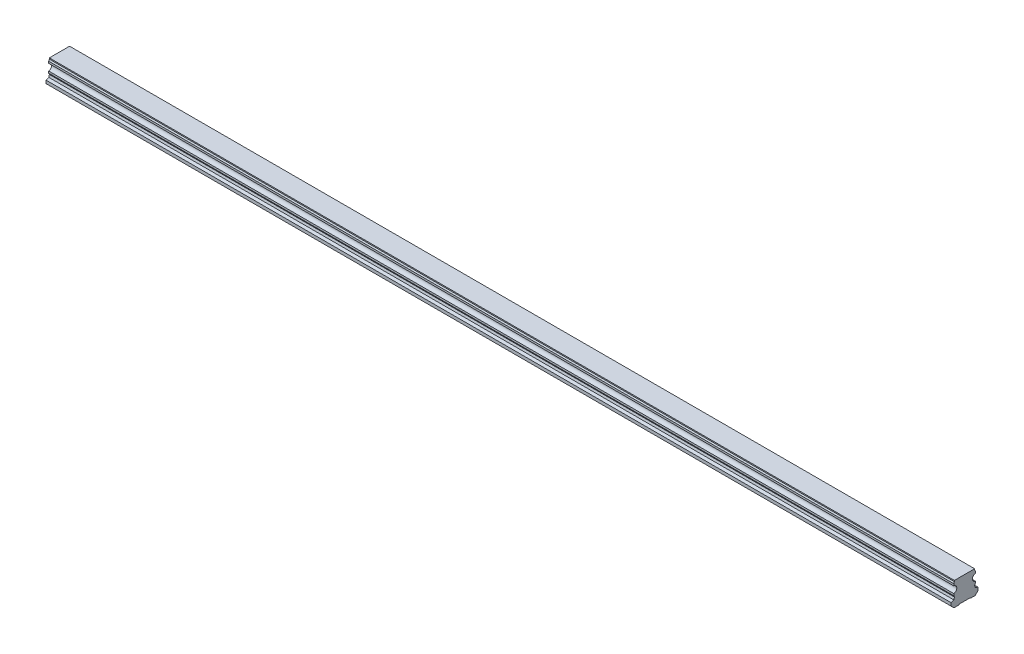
ISO-10303-21;
HEADER;
FILE_DESCRIPTION(('STEP AP214'),'2;1');
FILE_NAME('part.step','',(''),(''),'','','');
FILE_SCHEMA(('AUTOMOTIVE_DESIGN { 1 0 10303 214 1 1 1 1 }'));
ENDSEC;
DATA;
#1=APPLICATION_CONTEXT('core data for automotive mechanical design processes');
#2=APPLICATION_PROTOCOL_DEFINITION('international standard','automotive_design',2000,#1);
#3=PRODUCT_CONTEXT('',#1,'mechanical');
#4=PRODUCT('Part','Part','',(#3));
#5=PRODUCT_RELATED_PRODUCT_CATEGORY('part','',(#4));
#6=PRODUCT_DEFINITION_FORMATION('','',#4);
#7=PRODUCT_DEFINITION_CONTEXT('part definition',#1,'design');
#8=PRODUCT_DEFINITION('design','',#6,#7);
#9=PRODUCT_DEFINITION_SHAPE('','',#8);
#10=(LENGTH_UNIT() NAMED_UNIT(*) SI_UNIT(.MILLI.,.METRE.));
#11=(NAMED_UNIT(*) PLANE_ANGLE_UNIT() SI_UNIT($,.RADIAN.));
#12=(NAMED_UNIT(*) SI_UNIT($,.STERADIAN.) SOLID_ANGLE_UNIT());
#13=UNCERTAINTY_MEASURE_WITH_UNIT(LENGTH_MEASURE(1.E-05),#10,'distance_accuracy_value','');
#14=(GEOMETRIC_REPRESENTATION_CONTEXT(3) GLOBAL_UNCERTAINTY_ASSIGNED_CONTEXT((#13)) GLOBAL_UNIT_ASSIGNED_CONTEXT((#10,
#11,#12)) REPRESENTATION_CONTEXT('',''));
#15=CARTESIAN_POINT('',(0.,0.,0.));
#16=DIRECTION('',(0.,0.,1.));
#17=DIRECTION('',(1.,0.,0.));
#18=AXIS2_PLACEMENT_3D('',#15,#16,#17);
#19=CARTESIAN_POINT('',(810.,0.499999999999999,0.));
#20=DIRECTION('',(0.,-1.,0.));
#21=DIRECTION('',(0.,0.,-1.));
#22=AXIS2_PLACEMENT_3D('',#19,#20,#21);
#23=CONICAL_SURFACE('',#22,3.5,0.785398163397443);
#24=CARTESIAN_POINT('',(810.,1.00000000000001,0.));
#25=DIRECTION('',(0.,1.,0.));
#26=DIRECTION('',(0.,0.,1.));
#27=AXIS2_PLACEMENT_3D('',#24,#25,#26);
#28=CIRCLE('',#27,3.);
#29=CARTESIAN_POINT('',(810.,1.00000000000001,3.));
#30=VERTEX_POINT('',#29);
#31=EDGE_CURVE('E11',#30,#30,#28,.F.);
#32=ORIENTED_EDGE('',*,*,#31,.F.);
#33=EDGE_LOOP('',(#32));
#34=FACE_BOUND('',#33,.T.);
#35=CARTESIAN_POINT('',(810.,0.499999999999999,0.));
#36=DIRECTION('',(0.,1.,0.));
#37=DIRECTION('',(0.,0.,1.));
#38=AXIS2_PLACEMENT_3D('',#35,#36,#37);
#39=CIRCLE('',#38,3.5);
#40=CARTESIAN_POINT('',(810.,0.5,3.5));
#41=VERTEX_POINT('',#40);
#42=EDGE_CURVE('E565',#41,#41,#39,.T.);
#43=ORIENTED_EDGE('',*,*,#42,.F.);
#44=EDGE_LOOP('',(#43));
#45=FACE_BOUND('',#44,.T.);
#46=ADVANCED_FACE('F39',(#34,#45),#23,.F.);
#47=CARTESIAN_POINT('',(810.,12.,0.));
#48=DIRECTION('',(0.,-1.,0.));
#49=DIRECTION('',(0.,0.,-1.));
#50=AXIS2_PLACEMENT_3D('',#47,#48,#49);
#51=CYLINDRICAL_SURFACE('',#50,3.);
#52=ORIENTED_EDGE('',*,*,#31,.T.);
#53=EDGE_LOOP('',(#52));
#54=FACE_BOUND('',#53,.T.);
#55=CARTESIAN_POINT('',(810.,12.,0.));
#56=DIRECTION('',(0.,-1.,0.));
#57=DIRECTION('',(0.,0.,-1.));
#58=AXIS2_PLACEMENT_3D('',#55,#56,#57);
#59=CIRCLE('',#58,3.);
#60=CARTESIAN_POINT('',(810.,12.,-3.));
#61=VERTEX_POINT('',#60);
#62=EDGE_CURVE('E49',#61,#61,#59,.T.);
#63=ORIENTED_EDGE('',*,*,#62,.F.);
#64=EDGE_LOOP('',(#63));
#65=FACE_BOUND('',#64,.T.);
#66=ADVANCED_FACE('F790',(#54,#65),#51,.F.);
#67=CARTESIAN_POINT('',(810.,12.,0.));
#68=DIRECTION('',(0.,-1.,0.));
#69=DIRECTION('',(0.,0.,-1.));
#70=AXIS2_PLACEMENT_3D('',#67,#68,#69);
#71=PLANE('',#70);
#72=CARTESIAN_POINT('',(810.,12.,0.));
#73=DIRECTION('',(0.,-1.,0.));
#74=DIRECTION('',(0.,0.,-1.));
#75=AXIS2_PLACEMENT_3D('',#72,#73,#74);
#76=CIRCLE('',#75,2.5);
#77=CARTESIAN_POINT('',(810.,12.,-2.5));
#78=VERTEX_POINT('',#77);
#79=EDGE_CURVE('E42',#78,#78,#76,.T.);
#80=ORIENTED_EDGE('',*,*,#79,.F.);
#81=EDGE_LOOP('',(#80));
#82=FACE_BOUND('',#81,.T.);
#83=ORIENTED_EDGE('',*,*,#62,.T.);
#84=EDGE_LOOP('',(#83));
#85=FACE_BOUND('',#84,.T.);
#86=ADVANCED_FACE('F795',(#82,#85),#71,.T.);
#87=CARTESIAN_POINT('',(750.,0.499999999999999,0.));
#88=DIRECTION('',(0.,-1.,0.));
#89=DIRECTION('',(0.,0.,-1.));
#90=AXIS2_PLACEMENT_3D('',#87,#88,#89);
#91=CONICAL_SURFACE('',#90,3.5,0.785398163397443);
#92=CARTESIAN_POINT('',(750.,1.00000000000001,0.));
#93=DIRECTION('',(0.,1.,0.));
#94=DIRECTION('',(0.,0.,1.));
#95=AXIS2_PLACEMENT_3D('',#92,#93,#94);
#96=CIRCLE('',#95,3.);
#97=CARTESIAN_POINT('',(750.,1.00000000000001,3.));
#98=VERTEX_POINT('',#97);
#99=EDGE_CURVE('E561',#98,#98,#96,.F.);
#100=ORIENTED_EDGE('',*,*,#99,.F.);
#101=EDGE_LOOP('',(#100));
#102=FACE_BOUND('',#101,.T.);
#103=CARTESIAN_POINT('',(750.,0.499999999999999,0.));
#104=DIRECTION('',(0.,1.,0.));
#105=DIRECTION('',(0.,0.,1.));
#106=AXIS2_PLACEMENT_3D('',#103,#104,#105);
#107=CIRCLE('',#106,3.5);
#108=CARTESIAN_POINT('',(750.,0.5,3.5));
#109=VERTEX_POINT('',#108);
#110=EDGE_CURVE('E553',#109,#109,#107,.T.);
#111=ORIENTED_EDGE('',*,*,#110,.F.);
#112=EDGE_LOOP('',(#111));
#113=FACE_BOUND('',#112,.T.);
#114=ADVANCED_FACE('F1002',(#102,#113),#91,.F.);
#115=CARTESIAN_POINT('',(750.,12.,0.));
#116=DIRECTION('',(0.,-1.,0.));
#117=DIRECTION('',(0.,0.,-1.));
#118=AXIS2_PLACEMENT_3D('',#115,#116,#117);
#119=CYLINDRICAL_SURFACE('',#118,3.);
#120=ORIENTED_EDGE('',*,*,#99,.T.);
#121=EDGE_LOOP('',(#120));
#122=FACE_BOUND('',#121,.T.);
#123=CARTESIAN_POINT('',(750.,12.,0.));
#124=DIRECTION('',(0.,-1.,0.));
#125=DIRECTION('',(0.,0.,-1.));
#126=AXIS2_PLACEMENT_3D('',#123,#124,#125);
#127=CIRCLE('',#126,3.);
#128=CARTESIAN_POINT('',(750.,12.,-3.));
#129=VERTEX_POINT('',#128);
#130=EDGE_CURVE('E557',#129,#129,#127,.T.);
#131=ORIENTED_EDGE('',*,*,#130,.F.);
#132=EDGE_LOOP('',(#131));
#133=FACE_BOUND('',#132,.T.);
#134=ADVANCED_FACE('F998',(#122,#133),#119,.F.);
#135=CARTESIAN_POINT('',(750.,12.,0.));
#136=DIRECTION('',(0.,-1.,0.));
#137=DIRECTION('',(0.,0.,-1.));
#138=AXIS2_PLACEMENT_3D('',#135,#136,#137);
#139=PLANE('',#138);
#140=CARTESIAN_POINT('',(750.,12.,0.));
#141=DIRECTION('',(0.,-1.,0.));
#142=DIRECTION('',(0.,0.,-1.));
#143=AXIS2_PLACEMENT_3D('',#140,#141,#142);
#144=CIRCLE('',#143,2.5);
#145=CARTESIAN_POINT('',(750.,12.,-2.5));
#146=VERTEX_POINT('',#145);
#147=EDGE_CURVE('E616',#146,#146,#144,.T.);
#148=ORIENTED_EDGE('',*,*,#147,.F.);
#149=EDGE_LOOP('',(#148));
#150=FACE_BOUND('',#149,.T.);
#151=ORIENTED_EDGE('',*,*,#130,.T.);
#152=EDGE_LOOP('',(#151));
#153=FACE_BOUND('',#152,.T.);
#154=ADVANCED_FACE('F994',(#150,#153),#139,.T.);
#155=CARTESIAN_POINT('',(690.,0.499999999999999,0.));
#156=DIRECTION('',(0.,-1.,0.));
#157=DIRECTION('',(0.,0.,-1.));
#158=AXIS2_PLACEMENT_3D('',#155,#156,#157);
#159=CONICAL_SURFACE('',#158,3.5,0.785398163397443);
#160=CARTESIAN_POINT('',(690.,1.00000000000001,0.));
#161=DIRECTION('',(0.,1.,0.));
#162=DIRECTION('',(0.,0.,1.));
#163=AXIS2_PLACEMENT_3D('',#160,#161,#162);
#164=CIRCLE('',#163,3.);
#165=CARTESIAN_POINT('',(690.,1.00000000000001,3.));
#166=VERTEX_POINT('',#165);
#167=EDGE_CURVE('E549',#166,#166,#164,.F.);
#168=ORIENTED_EDGE('',*,*,#167,.F.);
#169=EDGE_LOOP('',(#168));
#170=FACE_BOUND('',#169,.T.);
#171=CARTESIAN_POINT('',(690.,0.499999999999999,0.));
#172=DIRECTION('',(0.,1.,0.));
#173=DIRECTION('',(0.,0.,1.));
#174=AXIS2_PLACEMENT_3D('',#171,#172,#173);
#175=CIRCLE('',#174,3.5);
#176=CARTESIAN_POINT('',(690.,0.5,3.5));
#177=VERTEX_POINT('',#176);
#178=EDGE_CURVE('E541',#177,#177,#175,.T.);
#179=ORIENTED_EDGE('',*,*,#178,.F.);
#180=EDGE_LOOP('',(#179));
#181=FACE_BOUND('',#180,.T.);
#182=ADVANCED_FACE('F990',(#170,#181),#159,.F.);
#183=CARTESIAN_POINT('',(690.,12.,0.));
#184=DIRECTION('',(0.,-1.,0.));
#185=DIRECTION('',(0.,0.,-1.));
#186=AXIS2_PLACEMENT_3D('',#183,#184,#185);
#187=CYLINDRICAL_SURFACE('',#186,3.);
#188=ORIENTED_EDGE('',*,*,#167,.T.);
#189=EDGE_LOOP('',(#188));
#190=FACE_BOUND('',#189,.T.);
#191=CARTESIAN_POINT('',(690.,12.,0.));
#192=DIRECTION('',(0.,-1.,0.));
#193=DIRECTION('',(0.,0.,-1.));
#194=AXIS2_PLACEMENT_3D('',#191,#192,#193);
#195=CIRCLE('',#194,3.);
#196=CARTESIAN_POINT('',(690.,12.,-3.));
#197=VERTEX_POINT('',#196);
#198=EDGE_CURVE('E545',#197,#197,#195,.T.);
#199=ORIENTED_EDGE('',*,*,#198,.F.);
#200=EDGE_LOOP('',(#199));
#201=FACE_BOUND('',#200,.T.);
#202=ADVANCED_FACE('F986',(#190,#201),#187,.F.);
#203=CARTESIAN_POINT('',(690.,12.,0.));
#204=DIRECTION('',(0.,-1.,0.));
#205=DIRECTION('',(0.,0.,-1.));
#206=AXIS2_PLACEMENT_3D('',#203,#204,#205);
#207=PLANE('',#206);
#208=CARTESIAN_POINT('',(690.,12.,0.));
#209=DIRECTION('',(0.,-1.,0.));
#210=DIRECTION('',(0.,0.,-1.));
#211=AXIS2_PLACEMENT_3D('',#208,#209,#210);
#212=CIRCLE('',#211,2.5);
#213=CARTESIAN_POINT('',(690.,12.,-2.5));
#214=VERTEX_POINT('',#213);
#215=EDGE_CURVE('E613',#214,#214,#212,.T.);
#216=ORIENTED_EDGE('',*,*,#215,.F.);
#217=EDGE_LOOP('',(#216));
#218=FACE_BOUND('',#217,.T.);
#219=ORIENTED_EDGE('',*,*,#198,.T.);
#220=EDGE_LOOP('',(#219));
#221=FACE_BOUND('',#220,.T.);
#222=ADVANCED_FACE('F982',(#218,#221),#207,.T.);
#223=CARTESIAN_POINT('',(630.,0.499999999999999,0.));
#224=DIRECTION('',(0.,-1.,0.));
#225=DIRECTION('',(0.,0.,-1.));
#226=AXIS2_PLACEMENT_3D('',#223,#224,#225);
#227=CONICAL_SURFACE('',#226,3.5,0.785398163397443);
#228=CARTESIAN_POINT('',(630.,1.00000000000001,0.));
#229=DIRECTION('',(0.,1.,0.));
#230=DIRECTION('',(0.,0.,1.));
#231=AXIS2_PLACEMENT_3D('',#228,#229,#230);
#232=CIRCLE('',#231,3.);
#233=CARTESIAN_POINT('',(630.,1.00000000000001,3.));
#234=VERTEX_POINT('',#233);
#235=EDGE_CURVE('E537',#234,#234,#232,.F.);
#236=ORIENTED_EDGE('',*,*,#235,.F.);
#237=EDGE_LOOP('',(#236));
#238=FACE_BOUND('',#237,.T.);
#239=CARTESIAN_POINT('',(630.,0.499999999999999,0.));
#240=DIRECTION('',(0.,1.,0.));
#241=DIRECTION('',(0.,0.,1.));
#242=AXIS2_PLACEMENT_3D('',#239,#240,#241);
#243=CIRCLE('',#242,3.5);
#244=CARTESIAN_POINT('',(630.,0.5,3.5));
#245=VERTEX_POINT('',#244);
#246=EDGE_CURVE('E529',#245,#245,#243,.T.);
#247=ORIENTED_EDGE('',*,*,#246,.F.);
#248=EDGE_LOOP('',(#247));
#249=FACE_BOUND('',#248,.T.);
#250=ADVANCED_FACE('F978',(#238,#249),#227,.F.);
#251=CARTESIAN_POINT('',(630.,12.,0.));
#252=DIRECTION('',(0.,-1.,0.));
#253=DIRECTION('',(0.,0.,-1.));
#254=AXIS2_PLACEMENT_3D('',#251,#252,#253);
#255=CYLINDRICAL_SURFACE('',#254,3.);
#256=ORIENTED_EDGE('',*,*,#235,.T.);
#257=EDGE_LOOP('',(#256));
#258=FACE_BOUND('',#257,.T.);
#259=CARTESIAN_POINT('',(630.,12.,0.));
#260=DIRECTION('',(0.,-1.,0.));
#261=DIRECTION('',(0.,0.,-1.));
#262=AXIS2_PLACEMENT_3D('',#259,#260,#261);
#263=CIRCLE('',#262,3.);
#264=CARTESIAN_POINT('',(630.,12.,-3.));
#265=VERTEX_POINT('',#264);
#266=EDGE_CURVE('E533',#265,#265,#263,.T.);
#267=ORIENTED_EDGE('',*,*,#266,.F.);
#268=EDGE_LOOP('',(#267));
#269=FACE_BOUND('',#268,.T.);
#270=ADVANCED_FACE('F974',(#258,#269),#255,.F.);
#271=CARTESIAN_POINT('',(630.,12.,0.));
#272=DIRECTION('',(0.,-1.,0.));
#273=DIRECTION('',(0.,0.,-1.));
#274=AXIS2_PLACEMENT_3D('',#271,#272,#273);
#275=PLANE('',#274);
#276=CARTESIAN_POINT('',(630.,12.,0.));
#277=DIRECTION('',(0.,-1.,0.));
#278=DIRECTION('',(0.,0.,-1.));
#279=AXIS2_PLACEMENT_3D('',#276,#277,#278);
#280=CIRCLE('',#279,2.5);
#281=CARTESIAN_POINT('',(630.,12.,-2.5));
#282=VERTEX_POINT('',#281);
#283=EDGE_CURVE('E609',#282,#282,#280,.T.);
#284=ORIENTED_EDGE('',*,*,#283,.F.);
#285=EDGE_LOOP('',(#284));
#286=FACE_BOUND('',#285,.T.);
#287=ORIENTED_EDGE('',*,*,#266,.T.);
#288=EDGE_LOOP('',(#287));
#289=FACE_BOUND('',#288,.T.);
#290=ADVANCED_FACE('F970',(#286,#289),#275,.T.);
#291=CARTESIAN_POINT('',(570.,0.499999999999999,0.));
#292=DIRECTION('',(0.,-1.,0.));
#293=DIRECTION('',(0.,0.,-1.));
#294=AXIS2_PLACEMENT_3D('',#291,#292,#293);
#295=CONICAL_SURFACE('',#294,3.5,0.785398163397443);
#296=CARTESIAN_POINT('',(570.,1.00000000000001,0.));
#297=DIRECTION('',(0.,1.,0.));
#298=DIRECTION('',(0.,0.,1.));
#299=AXIS2_PLACEMENT_3D('',#296,#297,#298);
#300=CIRCLE('',#299,3.);
#301=CARTESIAN_POINT('',(570.,1.00000000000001,3.));
#302=VERTEX_POINT('',#301);
#303=EDGE_CURVE('E525',#302,#302,#300,.F.);
#304=ORIENTED_EDGE('',*,*,#303,.F.);
#305=EDGE_LOOP('',(#304));
#306=FACE_BOUND('',#305,.T.);
#307=CARTESIAN_POINT('',(570.,0.499999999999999,0.));
#308=DIRECTION('',(0.,1.,0.));
#309=DIRECTION('',(0.,0.,1.));
#310=AXIS2_PLACEMENT_3D('',#307,#308,#309);
#311=CIRCLE('',#310,3.5);
#312=CARTESIAN_POINT('',(570.,0.5,3.5));
#313=VERTEX_POINT('',#312);
#314=EDGE_CURVE('E517',#313,#313,#311,.T.);
#315=ORIENTED_EDGE('',*,*,#314,.F.);
#316=EDGE_LOOP('',(#315));
#317=FACE_BOUND('',#316,.T.);
#318=ADVANCED_FACE('F966',(#306,#317),#295,.F.);
#319=CARTESIAN_POINT('',(570.,12.,0.));
#320=DIRECTION('',(0.,-1.,0.));
#321=DIRECTION('',(0.,0.,-1.));
#322=AXIS2_PLACEMENT_3D('',#319,#320,#321);
#323=CYLINDRICAL_SURFACE('',#322,3.);
#324=ORIENTED_EDGE('',*,*,#303,.T.);
#325=EDGE_LOOP('',(#324));
#326=FACE_BOUND('',#325,.T.);
#327=CARTESIAN_POINT('',(570.,12.,0.));
#328=DIRECTION('',(0.,-1.,0.));
#329=DIRECTION('',(0.,0.,-1.));
#330=AXIS2_PLACEMENT_3D('',#327,#328,#329);
#331=CIRCLE('',#330,3.);
#332=CARTESIAN_POINT('',(570.,12.,-3.));
#333=VERTEX_POINT('',#332);
#334=EDGE_CURVE('E521',#333,#333,#331,.T.);
#335=ORIENTED_EDGE('',*,*,#334,.F.);
#336=EDGE_LOOP('',(#335));
#337=FACE_BOUND('',#336,.T.);
#338=ADVANCED_FACE('F962',(#326,#337),#323,.F.);
#339=CARTESIAN_POINT('',(570.,12.,0.));
#340=DIRECTION('',(0.,-1.,0.));
#341=DIRECTION('',(0.,0.,-1.));
#342=AXIS2_PLACEMENT_3D('',#339,#340,#341);
#343=PLANE('',#342);
#344=CARTESIAN_POINT('',(570.,12.,0.));
#345=DIRECTION('',(0.,-1.,0.));
#346=DIRECTION('',(0.,0.,-1.));
#347=AXIS2_PLACEMENT_3D('',#344,#345,#346);
#348=CIRCLE('',#347,2.5);
#349=CARTESIAN_POINT('',(570.,12.,-2.5));
#350=VERTEX_POINT('',#349);
#351=EDGE_CURVE('E605',#350,#350,#348,.T.);
#352=ORIENTED_EDGE('',*,*,#351,.F.);
#353=EDGE_LOOP('',(#352));
#354=FACE_BOUND('',#353,.T.);
#355=ORIENTED_EDGE('',*,*,#334,.T.);
#356=EDGE_LOOP('',(#355));
#357=FACE_BOUND('',#356,.T.);
#358=ADVANCED_FACE('F958',(#354,#357),#343,.T.);
#359=CARTESIAN_POINT('',(510.,0.499999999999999,0.));
#360=DIRECTION('',(0.,-1.,0.));
#361=DIRECTION('',(0.,0.,-1.));
#362=AXIS2_PLACEMENT_3D('',#359,#360,#361);
#363=CONICAL_SURFACE('',#362,3.5,0.785398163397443);
#364=CARTESIAN_POINT('',(510.,1.00000000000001,0.));
#365=DIRECTION('',(0.,1.,0.));
#366=DIRECTION('',(0.,0.,1.));
#367=AXIS2_PLACEMENT_3D('',#364,#365,#366);
#368=CIRCLE('',#367,3.);
#369=CARTESIAN_POINT('',(510.,1.00000000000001,3.));
#370=VERTEX_POINT('',#369);
#371=EDGE_CURVE('E513',#370,#370,#368,.F.);
#372=ORIENTED_EDGE('',*,*,#371,.F.);
#373=EDGE_LOOP('',(#372));
#374=FACE_BOUND('',#373,.T.);
#375=CARTESIAN_POINT('',(510.,0.499999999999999,0.));
#376=DIRECTION('',(0.,1.,0.));
#377=DIRECTION('',(0.,0.,1.));
#378=AXIS2_PLACEMENT_3D('',#375,#376,#377);
#379=CIRCLE('',#378,3.5);
#380=CARTESIAN_POINT('',(510.,0.5,3.5));
#381=VERTEX_POINT('',#380);
#382=EDGE_CURVE('E505',#381,#381,#379,.T.);
#383=ORIENTED_EDGE('',*,*,#382,.F.);
#384=EDGE_LOOP('',(#383));
#385=FACE_BOUND('',#384,.T.);
#386=ADVANCED_FACE('F954',(#374,#385),#363,.F.);
#387=CARTESIAN_POINT('',(510.,12.,0.));
#388=DIRECTION('',(0.,-1.,0.));
#389=DIRECTION('',(0.,0.,-1.));
#390=AXIS2_PLACEMENT_3D('',#387,#388,#389);
#391=CYLINDRICAL_SURFACE('',#390,3.);
#392=ORIENTED_EDGE('',*,*,#371,.T.);
#393=EDGE_LOOP('',(#392));
#394=FACE_BOUND('',#393,.T.);
#395=CARTESIAN_POINT('',(510.,12.,0.));
#396=DIRECTION('',(0.,-1.,0.));
#397=DIRECTION('',(0.,0.,-1.));
#398=AXIS2_PLACEMENT_3D('',#395,#396,#397);
#399=CIRCLE('',#398,3.);
#400=CARTESIAN_POINT('',(510.,12.,-3.));
#401=VERTEX_POINT('',#400);
#402=EDGE_CURVE('E509',#401,#401,#399,.T.);
#403=ORIENTED_EDGE('',*,*,#402,.F.);
#404=EDGE_LOOP('',(#403));
#405=FACE_BOUND('',#404,.T.);
#406=ADVANCED_FACE('F950',(#394,#405),#391,.F.);
#407=CARTESIAN_POINT('',(510.,12.,0.));
#408=DIRECTION('',(0.,-1.,0.));
#409=DIRECTION('',(0.,0.,-1.));
#410=AXIS2_PLACEMENT_3D('',#407,#408,#409);
#411=PLANE('',#410);
#412=CARTESIAN_POINT('',(510.,12.,0.));
#413=DIRECTION('',(0.,-1.,0.));
#414=DIRECTION('',(0.,0.,-1.));
#415=AXIS2_PLACEMENT_3D('',#412,#413,#414);
#416=CIRCLE('',#415,2.5);
#417=CARTESIAN_POINT('',(510.,12.,-2.5));
#418=VERTEX_POINT('',#417);
#419=EDGE_CURVE('E601',#418,#418,#416,.T.);
#420=ORIENTED_EDGE('',*,*,#419,.F.);
#421=EDGE_LOOP('',(#420));
#422=FACE_BOUND('',#421,.T.);
#423=ORIENTED_EDGE('',*,*,#402,.T.);
#424=EDGE_LOOP('',(#423));
#425=FACE_BOUND('',#424,.T.);
#426=ADVANCED_FACE('F946',(#422,#425),#411,.T.);
#427=CARTESIAN_POINT('',(450.,0.499999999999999,0.));
#428=DIRECTION('',(0.,-1.,0.));
#429=DIRECTION('',(0.,0.,-1.));
#430=AXIS2_PLACEMENT_3D('',#427,#428,#429);
#431=CONICAL_SURFACE('',#430,3.5,0.785398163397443);
#432=CARTESIAN_POINT('',(450.,1.00000000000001,0.));
#433=DIRECTION('',(0.,1.,0.));
#434=DIRECTION('',(0.,0.,1.));
#435=AXIS2_PLACEMENT_3D('',#432,#433,#434);
#436=CIRCLE('',#435,3.);
#437=CARTESIAN_POINT('',(450.,1.00000000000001,3.));
#438=VERTEX_POINT('',#437);
#439=EDGE_CURVE('E501',#438,#438,#436,.F.);
#440=ORIENTED_EDGE('',*,*,#439,.F.);
#441=EDGE_LOOP('',(#440));
#442=FACE_BOUND('',#441,.T.);
#443=CARTESIAN_POINT('',(450.,0.499999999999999,0.));
#444=DIRECTION('',(0.,1.,0.));
#445=DIRECTION('',(0.,0.,1.));
#446=AXIS2_PLACEMENT_3D('',#443,#444,#445);
#447=CIRCLE('',#446,3.5);
#448=CARTESIAN_POINT('',(450.,0.5,3.5));
#449=VERTEX_POINT('',#448);
#450=EDGE_CURVE('E493',#449,#449,#447,.T.);
#451=ORIENTED_EDGE('',*,*,#450,.F.);
#452=EDGE_LOOP('',(#451));
#453=FACE_BOUND('',#452,.T.);
#454=ADVANCED_FACE('F942',(#442,#453),#431,.F.);
#455=CARTESIAN_POINT('',(450.,12.,0.));
#456=DIRECTION('',(0.,-1.,0.));
#457=DIRECTION('',(0.,0.,-1.));
#458=AXIS2_PLACEMENT_3D('',#455,#456,#457);
#459=CYLINDRICAL_SURFACE('',#458,3.);
#460=ORIENTED_EDGE('',*,*,#439,.T.);
#461=EDGE_LOOP('',(#460));
#462=FACE_BOUND('',#461,.T.);
#463=CARTESIAN_POINT('',(450.,12.,0.));
#464=DIRECTION('',(0.,-1.,0.));
#465=DIRECTION('',(0.,0.,-1.));
#466=AXIS2_PLACEMENT_3D('',#463,#464,#465);
#467=CIRCLE('',#466,3.);
#468=CARTESIAN_POINT('',(450.,12.,-3.));
#469=VERTEX_POINT('',#468);
#470=EDGE_CURVE('E497',#469,#469,#467,.T.);
#471=ORIENTED_EDGE('',*,*,#470,.F.);
#472=EDGE_LOOP('',(#471));
#473=FACE_BOUND('',#472,.T.);
#474=ADVANCED_FACE('F938',(#462,#473),#459,.F.);
#475=CARTESIAN_POINT('',(450.,12.,0.));
#476=DIRECTION('',(0.,-1.,0.));
#477=DIRECTION('',(0.,0.,-1.));
#478=AXIS2_PLACEMENT_3D('',#475,#476,#477);
#479=PLANE('',#478);
#480=CARTESIAN_POINT('',(450.,12.,0.));
#481=DIRECTION('',(0.,-1.,0.));
#482=DIRECTION('',(0.,0.,-1.));
#483=AXIS2_PLACEMENT_3D('',#480,#481,#482);
#484=CIRCLE('',#483,2.5);
#485=CARTESIAN_POINT('',(450.,12.,-2.5));
#486=VERTEX_POINT('',#485);
#487=EDGE_CURVE('E597',#486,#486,#484,.T.);
#488=ORIENTED_EDGE('',*,*,#487,.F.);
#489=EDGE_LOOP('',(#488));
#490=FACE_BOUND('',#489,.T.);
#491=ORIENTED_EDGE('',*,*,#470,.T.);
#492=EDGE_LOOP('',(#491));
#493=FACE_BOUND('',#492,.T.);
#494=ADVANCED_FACE('F934',(#490,#493),#479,.T.);
#495=CARTESIAN_POINT('',(390.,0.499999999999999,0.));
#496=DIRECTION('',(0.,-1.,0.));
#497=DIRECTION('',(0.,0.,-1.));
#498=AXIS2_PLACEMENT_3D('',#495,#496,#497);
#499=CONICAL_SURFACE('',#498,3.5,0.785398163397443);
#500=CARTESIAN_POINT('',(390.,1.00000000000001,0.));
#501=DIRECTION('',(0.,1.,0.));
#502=DIRECTION('',(0.,0.,1.));
#503=AXIS2_PLACEMENT_3D('',#500,#501,#502);
#504=CIRCLE('',#503,3.);
#505=CARTESIAN_POINT('',(390.,1.00000000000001,3.));
#506=VERTEX_POINT('',#505);
#507=EDGE_CURVE('E489',#506,#506,#504,.F.);
#508=ORIENTED_EDGE('',*,*,#507,.F.);
#509=EDGE_LOOP('',(#508));
#510=FACE_BOUND('',#509,.T.);
#511=CARTESIAN_POINT('',(390.,0.499999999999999,0.));
#512=DIRECTION('',(0.,1.,0.));
#513=DIRECTION('',(0.,0.,1.));
#514=AXIS2_PLACEMENT_3D('',#511,#512,#513);
#515=CIRCLE('',#514,3.5);
#516=CARTESIAN_POINT('',(390.,0.5,3.5));
#517=VERTEX_POINT('',#516);
#518=EDGE_CURVE('E481',#517,#517,#515,.T.);
#519=ORIENTED_EDGE('',*,*,#518,.F.);
#520=EDGE_LOOP('',(#519));
#521=FACE_BOUND('',#520,.T.);
#522=ADVANCED_FACE('F930',(#510,#521),#499,.F.);
#523=CARTESIAN_POINT('',(390.,12.,0.));
#524=DIRECTION('',(0.,-1.,0.));
#525=DIRECTION('',(0.,0.,-1.));
#526=AXIS2_PLACEMENT_3D('',#523,#524,#525);
#527=CYLINDRICAL_SURFACE('',#526,3.);
#528=ORIENTED_EDGE('',*,*,#507,.T.);
#529=EDGE_LOOP('',(#528));
#530=FACE_BOUND('',#529,.T.);
#531=CARTESIAN_POINT('',(390.,12.,0.));
#532=DIRECTION('',(0.,-1.,0.));
#533=DIRECTION('',(0.,0.,-1.));
#534=AXIS2_PLACEMENT_3D('',#531,#532,#533);
#535=CIRCLE('',#534,3.);
#536=CARTESIAN_POINT('',(390.,12.,-3.));
#537=VERTEX_POINT('',#536);
#538=EDGE_CURVE('E485',#537,#537,#535,.T.);
#539=ORIENTED_EDGE('',*,*,#538,.F.);
#540=EDGE_LOOP('',(#539));
#541=FACE_BOUND('',#540,.T.);
#542=ADVANCED_FACE('F926',(#530,#541),#527,.F.);
#543=CARTESIAN_POINT('',(390.,12.,0.));
#544=DIRECTION('',(0.,-1.,0.));
#545=DIRECTION('',(0.,0.,-1.));
#546=AXIS2_PLACEMENT_3D('',#543,#544,#545);
#547=PLANE('',#546);
#548=CARTESIAN_POINT('',(390.,12.,0.));
#549=DIRECTION('',(0.,-1.,0.));
#550=DIRECTION('',(0.,0.,-1.));
#551=AXIS2_PLACEMENT_3D('',#548,#549,#550);
#552=CIRCLE('',#551,2.5);
#553=CARTESIAN_POINT('',(390.,12.,-2.5));
#554=VERTEX_POINT('',#553);
#555=EDGE_CURVE('E593',#554,#554,#552,.T.);
#556=ORIENTED_EDGE('',*,*,#555,.F.);
#557=EDGE_LOOP('',(#556));
#558=FACE_BOUND('',#557,.T.);
#559=ORIENTED_EDGE('',*,*,#538,.T.);
#560=EDGE_LOOP('',(#559));
#561=FACE_BOUND('',#560,.T.);
#562=ADVANCED_FACE('F922',(#558,#561),#547,.T.);
#563=CARTESIAN_POINT('',(330.,0.499999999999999,0.));
#564=DIRECTION('',(0.,-1.,0.));
#565=DIRECTION('',(0.,0.,-1.));
#566=AXIS2_PLACEMENT_3D('',#563,#564,#565);
#567=CONICAL_SURFACE('',#566,3.5,0.785398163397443);
#568=CARTESIAN_POINT('',(330.,1.00000000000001,0.));
#569=DIRECTION('',(0.,1.,0.));
#570=DIRECTION('',(0.,0.,1.));
#571=AXIS2_PLACEMENT_3D('',#568,#569,#570);
#572=CIRCLE('',#571,3.);
#573=CARTESIAN_POINT('',(330.,1.00000000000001,3.));
#574=VERTEX_POINT('',#573);
#575=EDGE_CURVE('E477',#574,#574,#572,.F.);
#576=ORIENTED_EDGE('',*,*,#575,.F.);
#577=EDGE_LOOP('',(#576));
#578=FACE_BOUND('',#577,.T.);
#579=CARTESIAN_POINT('',(330.,0.499999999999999,0.));
#580=DIRECTION('',(0.,1.,0.));
#581=DIRECTION('',(0.,0.,1.));
#582=AXIS2_PLACEMENT_3D('',#579,#580,#581);
#583=CIRCLE('',#582,3.5);
#584=CARTESIAN_POINT('',(330.,0.5,3.5));
#585=VERTEX_POINT('',#584);
#586=EDGE_CURVE('E469',#585,#585,#583,.T.);
#587=ORIENTED_EDGE('',*,*,#586,.F.);
#588=EDGE_LOOP('',(#587));
#589=FACE_BOUND('',#588,.T.);
#590=ADVANCED_FACE('F918',(#578,#589),#567,.F.);
#591=CARTESIAN_POINT('',(330.,12.,0.));
#592=DIRECTION('',(0.,-1.,0.));
#593=DIRECTION('',(0.,0.,-1.));
#594=AXIS2_PLACEMENT_3D('',#591,#592,#593);
#595=CYLINDRICAL_SURFACE('',#594,3.);
#596=ORIENTED_EDGE('',*,*,#575,.T.);
#597=EDGE_LOOP('',(#596));
#598=FACE_BOUND('',#597,.T.);
#599=CARTESIAN_POINT('',(330.,12.,0.));
#600=DIRECTION('',(0.,-1.,0.));
#601=DIRECTION('',(0.,0.,-1.));
#602=AXIS2_PLACEMENT_3D('',#599,#600,#601);
#603=CIRCLE('',#602,3.);
#604=CARTESIAN_POINT('',(330.,12.,-3.));
#605=VERTEX_POINT('',#604);
#606=EDGE_CURVE('E473',#605,#605,#603,.T.);
#607=ORIENTED_EDGE('',*,*,#606,.F.);
#608=EDGE_LOOP('',(#607));
#609=FACE_BOUND('',#608,.T.);
#610=ADVANCED_FACE('F914',(#598,#609),#595,.F.);
#611=CARTESIAN_POINT('',(330.,12.,0.));
#612=DIRECTION('',(0.,-1.,0.));
#613=DIRECTION('',(0.,0.,-1.));
#614=AXIS2_PLACEMENT_3D('',#611,#612,#613);
#615=PLANE('',#614);
#616=CARTESIAN_POINT('',(330.,12.,0.));
#617=DIRECTION('',(0.,-1.,0.));
#618=DIRECTION('',(0.,0.,-1.));
#619=AXIS2_PLACEMENT_3D('',#616,#617,#618);
#620=CIRCLE('',#619,2.5);
#621=CARTESIAN_POINT('',(330.,12.,-2.5));
#622=VERTEX_POINT('',#621);
#623=EDGE_CURVE('E589',#622,#622,#620,.T.);
#624=ORIENTED_EDGE('',*,*,#623,.F.);
#625=EDGE_LOOP('',(#624));
#626=FACE_BOUND('',#625,.T.);
#627=ORIENTED_EDGE('',*,*,#606,.T.);
#628=EDGE_LOOP('',(#627));
#629=FACE_BOUND('',#628,.T.);
#630=ADVANCED_FACE('F910',(#626,#629),#615,.T.);
#631=CARTESIAN_POINT('',(270.,0.499999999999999,0.));
#632=DIRECTION('',(0.,-1.,0.));
#633=DIRECTION('',(0.,0.,-1.));
#634=AXIS2_PLACEMENT_3D('',#631,#632,#633);
#635=CONICAL_SURFACE('',#634,3.5,0.785398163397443);
#636=CARTESIAN_POINT('',(270.,1.00000000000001,0.));
#637=DIRECTION('',(0.,1.,0.));
#638=DIRECTION('',(0.,0.,1.));
#639=AXIS2_PLACEMENT_3D('',#636,#637,#638);
#640=CIRCLE('',#639,3.);
#641=CARTESIAN_POINT('',(270.,1.00000000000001,3.));
#642=VERTEX_POINT('',#641);
#643=EDGE_CURVE('E465',#642,#642,#640,.F.);
#644=ORIENTED_EDGE('',*,*,#643,.F.);
#645=EDGE_LOOP('',(#644));
#646=FACE_BOUND('',#645,.T.);
#647=CARTESIAN_POINT('',(270.,0.499999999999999,0.));
#648=DIRECTION('',(0.,1.,0.));
#649=DIRECTION('',(0.,0.,1.));
#650=AXIS2_PLACEMENT_3D('',#647,#648,#649);
#651=CIRCLE('',#650,3.5);
#652=CARTESIAN_POINT('',(270.,0.5,3.5));
#653=VERTEX_POINT('',#652);
#654=EDGE_CURVE('E457',#653,#653,#651,.T.);
#655=ORIENTED_EDGE('',*,*,#654,.F.);
#656=EDGE_LOOP('',(#655));
#657=FACE_BOUND('',#656,.T.);
#658=ADVANCED_FACE('F906',(#646,#657),#635,.F.);
#659=CARTESIAN_POINT('',(270.,12.,0.));
#660=DIRECTION('',(0.,-1.,0.));
#661=DIRECTION('',(0.,0.,-1.));
#662=AXIS2_PLACEMENT_3D('',#659,#660,#661);
#663=CYLINDRICAL_SURFACE('',#662,3.);
#664=ORIENTED_EDGE('',*,*,#643,.T.);
#665=EDGE_LOOP('',(#664));
#666=FACE_BOUND('',#665,.T.);
#667=CARTESIAN_POINT('',(270.,12.,0.));
#668=DIRECTION('',(0.,-1.,0.));
#669=DIRECTION('',(0.,0.,-1.));
#670=AXIS2_PLACEMENT_3D('',#667,#668,#669);
#671=CIRCLE('',#670,3.);
#672=CARTESIAN_POINT('',(270.,12.,-3.));
#673=VERTEX_POINT('',#672);
#674=EDGE_CURVE('E461',#673,#673,#671,.T.);
#675=ORIENTED_EDGE('',*,*,#674,.F.);
#676=EDGE_LOOP('',(#675));
#677=FACE_BOUND('',#676,.T.);
#678=ADVANCED_FACE('F902',(#666,#677),#663,.F.);
#679=CARTESIAN_POINT('',(270.,12.,0.));
#680=DIRECTION('',(0.,-1.,0.));
#681=DIRECTION('',(0.,0.,-1.));
#682=AXIS2_PLACEMENT_3D('',#679,#680,#681);
#683=PLANE('',#682);
#684=CARTESIAN_POINT('',(270.,12.,0.));
#685=DIRECTION('',(0.,-1.,0.));
#686=DIRECTION('',(0.,0.,-1.));
#687=AXIS2_PLACEMENT_3D('',#684,#685,#686);
#688=CIRCLE('',#687,2.5);
#689=CARTESIAN_POINT('',(270.,12.,-2.5));
#690=VERTEX_POINT('',#689);
#691=EDGE_CURVE('E585',#690,#690,#688,.T.);
#692=ORIENTED_EDGE('',*,*,#691,.F.);
#693=EDGE_LOOP('',(#692));
#694=FACE_BOUND('',#693,.T.);
#695=ORIENTED_EDGE('',*,*,#674,.T.);
#696=EDGE_LOOP('',(#695));
#697=FACE_BOUND('',#696,.T.);
#698=ADVANCED_FACE('F898',(#694,#697),#683,.T.);
#699=CARTESIAN_POINT('',(210.,0.499999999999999,0.));
#700=DIRECTION('',(0.,-1.,0.));
#701=DIRECTION('',(0.,0.,-1.));
#702=AXIS2_PLACEMENT_3D('',#699,#700,#701);
#703=CONICAL_SURFACE('',#702,3.5,0.785398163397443);
#704=CARTESIAN_POINT('',(210.,1.00000000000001,0.));
#705=DIRECTION('',(0.,1.,0.));
#706=DIRECTION('',(0.,0.,1.));
#707=AXIS2_PLACEMENT_3D('',#704,#705,#706);
#708=CIRCLE('',#707,3.);
#709=CARTESIAN_POINT('',(210.,1.00000000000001,3.));
#710=VERTEX_POINT('',#709);
#711=EDGE_CURVE('E453',#710,#710,#708,.F.);
#712=ORIENTED_EDGE('',*,*,#711,.F.);
#713=EDGE_LOOP('',(#712));
#714=FACE_BOUND('',#713,.T.);
#715=CARTESIAN_POINT('',(210.,0.499999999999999,0.));
#716=DIRECTION('',(0.,1.,0.));
#717=DIRECTION('',(0.,0.,1.));
#718=AXIS2_PLACEMENT_3D('',#715,#716,#717);
#719=CIRCLE('',#718,3.5);
#720=CARTESIAN_POINT('',(210.,0.5,3.5));
#721=VERTEX_POINT('',#720);
#722=EDGE_CURVE('E445',#721,#721,#719,.T.);
#723=ORIENTED_EDGE('',*,*,#722,.F.);
#724=EDGE_LOOP('',(#723));
#725=FACE_BOUND('',#724,.T.);
#726=ADVANCED_FACE('F894',(#714,#725),#703,.F.);
#727=CARTESIAN_POINT('',(210.,12.,0.));
#728=DIRECTION('',(0.,-1.,0.));
#729=DIRECTION('',(0.,0.,-1.));
#730=AXIS2_PLACEMENT_3D('',#727,#728,#729);
#731=CYLINDRICAL_SURFACE('',#730,3.);
#732=ORIENTED_EDGE('',*,*,#711,.T.);
#733=EDGE_LOOP('',(#732));
#734=FACE_BOUND('',#733,.T.);
#735=CARTESIAN_POINT('',(210.,12.,0.));
#736=DIRECTION('',(0.,-1.,0.));
#737=DIRECTION('',(0.,0.,-1.));
#738=AXIS2_PLACEMENT_3D('',#735,#736,#737);
#739=CIRCLE('',#738,3.);
#740=CARTESIAN_POINT('',(210.,12.,-3.));
#741=VERTEX_POINT('',#740);
#742=EDGE_CURVE('E449',#741,#741,#739,.T.);
#743=ORIENTED_EDGE('',*,*,#742,.F.);
#744=EDGE_LOOP('',(#743));
#745=FACE_BOUND('',#744,.T.);
#746=ADVANCED_FACE('F890',(#734,#745),#731,.F.);
#747=CARTESIAN_POINT('',(210.,12.,0.));
#748=DIRECTION('',(0.,-1.,0.));
#749=DIRECTION('',(0.,0.,-1.));
#750=AXIS2_PLACEMENT_3D('',#747,#748,#749);
#751=PLANE('',#750);
#752=CARTESIAN_POINT('',(210.,12.,0.));
#753=DIRECTION('',(0.,-1.,0.));
#754=DIRECTION('',(0.,0.,-1.));
#755=AXIS2_PLACEMENT_3D('',#752,#753,#754);
#756=CIRCLE('',#755,2.5);
#757=CARTESIAN_POINT('',(210.,12.,-2.5));
#758=VERTEX_POINT('',#757);
#759=EDGE_CURVE('E581',#758,#758,#756,.T.);
#760=ORIENTED_EDGE('',*,*,#759,.F.);
#761=EDGE_LOOP('',(#760));
#762=FACE_BOUND('',#761,.T.);
#763=ORIENTED_EDGE('',*,*,#742,.T.);
#764=EDGE_LOOP('',(#763));
#765=FACE_BOUND('',#764,.T.);
#766=ADVANCED_FACE('F886',(#762,#765),#751,.T.);
#767=CARTESIAN_POINT('',(150.,0.499999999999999,0.));
#768=DIRECTION('',(0.,-1.,0.));
#769=DIRECTION('',(0.,0.,-1.));
#770=AXIS2_PLACEMENT_3D('',#767,#768,#769);
#771=CONICAL_SURFACE('',#770,3.5,0.785398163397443);
#772=CARTESIAN_POINT('',(150.,1.00000000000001,0.));
#773=DIRECTION('',(0.,1.,0.));
#774=DIRECTION('',(0.,0.,1.));
#775=AXIS2_PLACEMENT_3D('',#772,#773,#774);
#776=CIRCLE('',#775,3.);
#777=CARTESIAN_POINT('',(150.,1.00000000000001,3.));
#778=VERTEX_POINT('',#777);
#779=EDGE_CURVE('E441',#778,#778,#776,.F.);
#780=ORIENTED_EDGE('',*,*,#779,.F.);
#781=EDGE_LOOP('',(#780));
#782=FACE_BOUND('',#781,.T.);
#783=CARTESIAN_POINT('',(150.,0.499999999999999,0.));
#784=DIRECTION('',(0.,1.,0.));
#785=DIRECTION('',(0.,0.,1.));
#786=AXIS2_PLACEMENT_3D('',#783,#784,#785);
#787=CIRCLE('',#786,3.5);
#788=CARTESIAN_POINT('',(150.,0.5,3.5));
#789=VERTEX_POINT('',#788);
#790=EDGE_CURVE('E433',#789,#789,#787,.T.);
#791=ORIENTED_EDGE('',*,*,#790,.F.);
#792=EDGE_LOOP('',(#791));
#793=FACE_BOUND('',#792,.T.);
#794=ADVANCED_FACE('F882',(#782,#793),#771,.F.);
#795=CARTESIAN_POINT('',(150.,12.,0.));
#796=DIRECTION('',(0.,-1.,0.));
#797=DIRECTION('',(0.,0.,-1.));
#798=AXIS2_PLACEMENT_3D('',#795,#796,#797);
#799=CYLINDRICAL_SURFACE('',#798,3.);
#800=ORIENTED_EDGE('',*,*,#779,.T.);
#801=EDGE_LOOP('',(#800));
#802=FACE_BOUND('',#801,.T.);
#803=CARTESIAN_POINT('',(150.,12.,0.));
#804=DIRECTION('',(0.,-1.,0.));
#805=DIRECTION('',(0.,0.,-1.));
#806=AXIS2_PLACEMENT_3D('',#803,#804,#805);
#807=CIRCLE('',#806,3.);
#808=CARTESIAN_POINT('',(150.,12.,-3.));
#809=VERTEX_POINT('',#808);
#810=EDGE_CURVE('E437',#809,#809,#807,.T.);
#811=ORIENTED_EDGE('',*,*,#810,.F.);
#812=EDGE_LOOP('',(#811));
#813=FACE_BOUND('',#812,.T.);
#814=ADVANCED_FACE('F878',(#802,#813),#799,.F.);
#815=CARTESIAN_POINT('',(150.,12.,0.));
#816=DIRECTION('',(0.,-1.,0.));
#817=DIRECTION('',(0.,0.,-1.));
#818=AXIS2_PLACEMENT_3D('',#815,#816,#817);
#819=PLANE('',#818);
#820=CARTESIAN_POINT('',(150.,12.,0.));
#821=DIRECTION('',(0.,-1.,0.));
#822=DIRECTION('',(0.,0.,-1.));
#823=AXIS2_PLACEMENT_3D('',#820,#821,#822);
#824=CIRCLE('',#823,2.5);
#825=CARTESIAN_POINT('',(150.,12.,-2.5));
#826=VERTEX_POINT('',#825);
#827=EDGE_CURVE('E576',#826,#826,#824,.T.);
#828=ORIENTED_EDGE('',*,*,#827,.F.);
#829=EDGE_LOOP('',(#828));
#830=FACE_BOUND('',#829,.T.);
#831=ORIENTED_EDGE('',*,*,#810,.T.);
#832=EDGE_LOOP('',(#831));
#833=FACE_BOUND('',#832,.T.);
#834=ADVANCED_FACE('F868',(#830,#833),#819,.T.);
#835=CARTESIAN_POINT('',(840.,21.8,-9.375));
#836=DIRECTION('',(0.,0.,1.));
#837=DIRECTION('',(0.,-1.,0.));
#838=AXIS2_PLACEMENT_3D('',#835,#836,#837);
#839=PLANE('',#838);
#840=DIRECTION('',(0.,1.,0.));
#841=VECTOR('',#840,1.);
#842=CARTESIAN_POINT('',(0.,21.8,-9.375));
#843=LINE('',#842,#841);
#844=CARTESIAN_POINT('',(0.,20.756,-9.375));
#845=VERTEX_POINT('',#844);
#846=CARTESIAN_POINT('',(0.,21.8,-9.375));
#847=VERTEX_POINT('',#846);
#848=EDGE_CURVE('E254',#845,#847,#843,.T.);
#849=ORIENTED_EDGE('',*,*,#848,.T.);
#850=DIRECTION('',(-1.,0.,0.));
#851=VECTOR('',#850,1.);
#852=CARTESIAN_POINT('',(840.,21.8,-9.375));
#853=LINE('',#852,#851);
#854=CARTESIAN_POINT('',(840.,21.8,-9.375));
#855=VERTEX_POINT('',#854);
#856=EDGE_CURVE('E422',#855,#847,#853,.T.);
#857=ORIENTED_EDGE('',*,*,#856,.F.);
#858=DIRECTION('',(0.,1.,0.));
#859=VECTOR('',#858,1.);
#860=CARTESIAN_POINT('',(840.,21.8,-9.375));
#861=LINE('',#860,#859);
#862=CARTESIAN_POINT('',(840.,20.756,-9.375));
#863=VERTEX_POINT('',#862);
#864=EDGE_CURVE('E331',#863,#855,#861,.T.);
#865=ORIENTED_EDGE('',*,*,#864,.F.);
#866=DIRECTION('',(-1.,0.,0.));
#867=VECTOR('',#866,1.);
#868=CARTESIAN_POINT('',(840.,20.756,-9.375));
#869=LINE('',#868,#867);
#870=EDGE_CURVE('E250',#863,#845,#869,.T.);
#871=ORIENTED_EDGE('',*,*,#870,.T.);
#872=EDGE_LOOP('',(#849,#857,#865,#871));
#873=FACE_BOUND('',#872,.T.);
#874=ADVANCED_FACE('F865',(#873),#839,.F.);
#875=CARTESIAN_POINT('',(840.,21.8,-9.375));
#876=DIRECTION('',(0.,-1.,0.));
#877=DIRECTION('',(0.,0.,-1.));
#878=AXIS2_PLACEMENT_3D('',#875,#876,#877);
#879=PLANE('',#878);
#880=DIRECTION('',(0.,0.,1.));
#881=VECTOR('',#880,1.);
#882=CARTESIAN_POINT('',(0.,21.8,-9.375));
#883=LINE('',#882,#881);
#884=CARTESIAN_POINT('',(0.,21.8,9.375));
#885=VERTEX_POINT('',#884);
#886=EDGE_CURVE('E258',#847,#885,#883,.T.);
#887=ORIENTED_EDGE('',*,*,#886,.T.);
#888=DIRECTION('',(-1.,0.,0.));
#889=VECTOR('',#888,1.);
#890=CARTESIAN_POINT('',(840.,21.8,9.375));
#891=LINE('',#890,#889);
#892=CARTESIAN_POINT('',(840.,21.8,9.375));
#893=VERTEX_POINT('',#892);
#894=EDGE_CURVE('E418',#893,#885,#891,.T.);
#895=ORIENTED_EDGE('',*,*,#894,.F.);
#896=DIRECTION('',(0.,0.,1.));
#897=VECTOR('',#896,1.);
#898=CARTESIAN_POINT('',(840.,21.8,-9.375));
#899=LINE('',#898,#897);
#900=EDGE_CURVE('E157',#855,#893,#899,.T.);
#901=ORIENTED_EDGE('',*,*,#900,.F.);
#902=ORIENTED_EDGE('',*,*,#856,.T.);
#903=EDGE_LOOP('',(#887,#895,#901,#902));
#904=FACE_BOUND('',#903,.T.);
#905=ADVANCED_FACE('F861',(#904),#879,.F.);
#906=CARTESIAN_POINT('',(840.,21.8,9.375));
#907=DIRECTION('',(0.,0.,-1.));
#908=DIRECTION('',(0.,1.,0.));
#909=AXIS2_PLACEMENT_3D('',#906,#907,#908);
#910=PLANE('',#909);
#911=DIRECTION('',(0.,-1.,0.));
#912=VECTOR('',#911,1.);
#913=CARTESIAN_POINT('',(0.,21.8,9.375));
#914=LINE('',#913,#912);
#915=CARTESIAN_POINT('',(0.,20.756,9.37499999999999));
#916=VERTEX_POINT('',#915);
#917=EDGE_CURVE('E262',#885,#916,#914,.T.);
#918=ORIENTED_EDGE('',*,*,#917,.T.);
#919=DIRECTION('',(-1.,0.,0.));
#920=VECTOR('',#919,1.);
#921=CARTESIAN_POINT('',(840.,20.756,9.37499999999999));
#922=LINE('',#921,#920);
#923=CARTESIAN_POINT('',(840.,20.756,9.37499999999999));
#924=VERTEX_POINT('',#923);
#925=EDGE_CURVE('E414',#924,#916,#922,.T.);
#926=ORIENTED_EDGE('',*,*,#925,.F.);
#927=DIRECTION('',(0.,-1.,0.));
#928=VECTOR('',#927,1.);
#929=CARTESIAN_POINT('',(840.,21.8,9.375));
#930=LINE('',#929,#928);
#931=EDGE_CURVE('E661',#893,#924,#930,.T.);
#932=ORIENTED_EDGE('',*,*,#931,.F.);
#933=ORIENTED_EDGE('',*,*,#894,.T.);
#934=EDGE_LOOP('',(#918,#926,#932,#933));
#935=FACE_BOUND('',#934,.T.);
#936=ADVANCED_FACE('F857',(#935),#910,.F.);
#937=CARTESIAN_POINT('',(840.,20.756,9.37499999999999));
#938=DIRECTION('',(0.,-0.422618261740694,-0.906307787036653));
#939=DIRECTION('',(0.,0.906307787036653,-0.422618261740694));
#940=AXIS2_PLACEMENT_3D('',#937,#938,#939);
#941=PLANE('',#940);
#942=DIRECTION('',(0.,-0.906307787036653,0.422618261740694));
#943=VECTOR('',#942,1.);
#944=CARTESIAN_POINT('',(0.,20.756,9.37499999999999));
#945=LINE('',#944,#943);
#946=CARTESIAN_POINT('',(0.,19.4156831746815,10.));
#947=VERTEX_POINT('',#946);
#948=EDGE_CURVE('E265',#916,#947,#945,.T.);
#949=ORIENTED_EDGE('',*,*,#948,.T.);
#950=DIRECTION('',(-1.,0.,0.));
#951=VECTOR('',#950,1.);
#952=CARTESIAN_POINT('',(840.,19.4156831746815,10.));
#953=LINE('',#952,#951);
#954=CARTESIAN_POINT('',(840.,19.4156831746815,10.));
#955=VERTEX_POINT('',#954);
#956=EDGE_CURVE('E410',#955,#947,#953,.T.);
#957=ORIENTED_EDGE('',*,*,#956,.F.);
#958=DIRECTION('',(0.,-0.906307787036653,0.422618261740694));
#959=VECTOR('',#958,1.);
#960=CARTESIAN_POINT('',(840.,20.756,9.37499999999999));
#961=LINE('',#960,#959);
#962=EDGE_CURVE('E664',#924,#955,#961,.T.);
#963=ORIENTED_EDGE('',*,*,#962,.F.);
#964=ORIENTED_EDGE('',*,*,#925,.T.);
#965=EDGE_LOOP('',(#949,#957,#963,#964));
#966=FACE_BOUND('',#965,.T.);
#967=ADVANCED_FACE('F853',(#966),#941,.F.);
#968=CARTESIAN_POINT('',(840.,19.4156831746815,10.));
#969=DIRECTION('',(0.,0.,-1.));
#970=DIRECTION('',(-1.,0.,0.));
#971=AXIS2_PLACEMENT_3D('',#968,#969,#970);
#972=PLANE('',#971);
#973=DIRECTION('',(0.,-1.,0.));
#974=VECTOR('',#973,1.);
#975=CARTESIAN_POINT('',(0.,19.4156831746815,10.));
#976=LINE('',#975,#974);
#977=CARTESIAN_POINT('',(0.,17.6854497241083,10.));
#978=VERTEX_POINT('',#977);
#979=EDGE_CURVE('E268',#947,#978,#976,.T.);
#980=ORIENTED_EDGE('',*,*,#979,.T.);
#981=DIRECTION('',(-1.,0.,0.));
#982=VECTOR('',#981,1.);
#983=CARTESIAN_POINT('',(840.,17.6854497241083,10.));
#984=LINE('',#983,#982);
#985=CARTESIAN_POINT('',(840.,17.6854497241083,10.));
#986=VERTEX_POINT('',#985);
#987=EDGE_CURVE('E406',#986,#978,#984,.T.);
#988=ORIENTED_EDGE('',*,*,#987,.F.);
#989=DIRECTION('',(0.,-1.,0.));
#990=VECTOR('',#989,1.);
#991=CARTESIAN_POINT('',(840.,19.4156831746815,10.));
#992=LINE('',#991,#990);
#993=EDGE_CURVE('E667',#955,#986,#992,.T.);
#994=ORIENTED_EDGE('',*,*,#993,.F.);
#995=ORIENTED_EDGE('',*,*,#956,.T.);
#996=EDGE_LOOP('',(#980,#988,#994,#995));
#997=FACE_BOUND('',#996,.T.);
#998=ADVANCED_FACE('F849',(#997),#972,.F.);
#999=CARTESIAN_POINT('',(840.,14.6,10.3));
#1000=DIRECTION('',(-1.,0.,0.));
#1001=DIRECTION('',(0.,0.,1.));
#1002=AXIS2_PLACEMENT_3D('',#999,#1000,#1001);
#1003=CYLINDRICAL_SURFACE('',#1002,3.1);
#1004=CARTESIAN_POINT('',(0.,14.6,10.3));
#1005=DIRECTION('',(-1.,0.,0.));
#1006=DIRECTION('',(0.,0.,-1.));
#1007=AXIS2_PLACEMENT_3D('',#1004,#1005,#1006);
#1008=CIRCLE('',#1007,3.1);
#1009=CARTESIAN_POINT('',(0.,11.5145502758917,10.));
#1010=VERTEX_POINT('',#1009);
#1011=EDGE_CURVE('E271',#978,#1010,#1008,.T.);
#1012=ORIENTED_EDGE('',*,*,#1011,.T.);
#1013=DIRECTION('',(-1.,0.,0.));
#1014=VECTOR('',#1013,1.);
#1015=CARTESIAN_POINT('',(840.,11.5145502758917,10.));
#1016=LINE('',#1015,#1014);
#1017=CARTESIAN_POINT('',(840.,11.5145502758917,10.));
#1018=VERTEX_POINT('',#1017);
#1019=EDGE_CURVE('E402',#1018,#1010,#1016,.T.);
#1020=ORIENTED_EDGE('',*,*,#1019,.F.);
#1021=CARTESIAN_POINT('',(840.,14.6,10.3));
#1022=DIRECTION('',(-1.,0.,0.));
#1023=DIRECTION('',(0.,0.,-1.));
#1024=AXIS2_PLACEMENT_3D('',#1021,#1022,#1023);
#1025=CIRCLE('',#1024,3.1);
#1026=EDGE_CURVE('E670',#986,#1018,#1025,.T.);
#1027=ORIENTED_EDGE('',*,*,#1026,.F.);
#1028=ORIENTED_EDGE('',*,*,#987,.T.);
#1029=EDGE_LOOP('',(#1012,#1020,#1027,#1028));
#1030=FACE_BOUND('',#1029,.T.);
#1031=ADVANCED_FACE('F845',(#1030),#1003,.F.);
#1032=CARTESIAN_POINT('',(840.,9.78431682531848,10.));
#1033=DIRECTION('',(0.,0.,-1.));
#1034=DIRECTION('',(0.,1.,0.));
#1035=AXIS2_PLACEMENT_3D('',#1032,#1033,#1034);
#1036=PLANE('',#1035);
#1037=DIRECTION('',(0.,-1.,0.));
#1038=VECTOR('',#1037,1.);
#1039=CARTESIAN_POINT('',(0.,9.78431682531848,10.));
#1040=LINE('',#1039,#1038);
#1041=CARTESIAN_POINT('',(0.,9.78431682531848,10.));
#1042=VERTEX_POINT('',#1041);
#1043=EDGE_CURVE('E274',#1010,#1042,#1040,.T.);
#1044=ORIENTED_EDGE('',*,*,#1043,.T.);
#1045=DIRECTION('',(-1.,0.,0.));
#1046=VECTOR('',#1045,1.);
#1047=CARTESIAN_POINT('',(840.,9.78431682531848,10.));
#1048=LINE('',#1047,#1046);
#1049=CARTESIAN_POINT('',(840.,9.78431682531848,10.));
#1050=VERTEX_POINT('',#1049);
#1051=EDGE_CURVE('E398',#1050,#1042,#1048,.T.);
#1052=ORIENTED_EDGE('',*,*,#1051,.F.);
#1053=DIRECTION('',(0.,-1.,0.));
#1054=VECTOR('',#1053,1.);
#1055=CARTESIAN_POINT('',(840.,9.78431682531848,10.));
#1056=LINE('',#1055,#1054);
#1057=EDGE_CURVE('E673',#1018,#1050,#1056,.T.);
#1058=ORIENTED_EDGE('',*,*,#1057,.F.);
#1059=ORIENTED_EDGE('',*,*,#1019,.T.);
#1060=EDGE_LOOP('',(#1044,#1052,#1058,#1059));
#1061=FACE_BOUND('',#1060,.T.);
#1062=ADVANCED_FACE('F841',(#1061),#1036,.F.);
#1063=CARTESIAN_POINT('',(840.,8.44400000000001,9.375));
#1064=DIRECTION('',(0.,0.4226182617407,-0.90630778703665));
#1065=DIRECTION('',(0.,0.90630778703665,0.4226182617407));
#1066=AXIS2_PLACEMENT_3D('',#1063,#1064,#1065);
#1067=PLANE('',#1066);
#1068=DIRECTION('',(0.,-0.90630778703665,-0.4226182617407));
#1069=VECTOR('',#1068,1.);
#1070=CARTESIAN_POINT('',(0.,8.44400000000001,9.375));
#1071=LINE('',#1070,#1069);
#1072=CARTESIAN_POINT('',(0.,8.44400000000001,9.375));
#1073=VERTEX_POINT('',#1072);
#1074=EDGE_CURVE('E277',#1042,#1073,#1071,.T.);
#1075=ORIENTED_EDGE('',*,*,#1074,.T.);
#1076=DIRECTION('',(-1.,0.,0.));
#1077=VECTOR('',#1076,1.);
#1078=CARTESIAN_POINT('',(840.,8.44400000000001,9.375));
#1079=LINE('',#1078,#1077);
#1080=CARTESIAN_POINT('',(840.,8.44400000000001,9.375));
#1081=VERTEX_POINT('',#1080);
#1082=EDGE_CURVE('E394',#1081,#1073,#1079,.T.);
#1083=ORIENTED_EDGE('',*,*,#1082,.F.);
#1084=DIRECTION('',(0.,-0.90630778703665,-0.4226182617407));
#1085=VECTOR('',#1084,1.);
#1086=CARTESIAN_POINT('',(840.,8.44400000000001,9.375));
#1087=LINE('',#1086,#1085);
#1088=EDGE_CURVE('E676',#1050,#1081,#1087,.T.);
#1089=ORIENTED_EDGE('',*,*,#1088,.F.);
#1090=ORIENTED_EDGE('',*,*,#1051,.T.);
#1091=EDGE_LOOP('',(#1075,#1083,#1089,#1090));
#1092=FACE_BOUND('',#1091,.T.);
#1093=ADVANCED_FACE('F837',(#1092),#1067,.F.);
#1094=CARTESIAN_POINT('',(840.,6.4,9.92268814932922));
#1095=DIRECTION('',(0.,-0.258819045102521,-0.965925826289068));
#1096=DIRECTION('',(0.,0.965925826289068,-0.258819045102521));
#1097=AXIS2_PLACEMENT_3D('',#1094,#1095,#1096);
#1098=PLANE('',#1097);
#1099=DIRECTION('',(0.,-0.965925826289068,0.258819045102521));
#1100=VECTOR('',#1099,1.);
#1101=CARTESIAN_POINT('',(0.,6.4,9.92268814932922));
#1102=LINE('',#1101,#1100);
#1103=CARTESIAN_POINT('',(0.,6.4,9.92268814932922));
#1104=VERTEX_POINT('',#1103);
#1105=EDGE_CURVE('E280',#1073,#1104,#1102,.T.);
#1106=ORIENTED_EDGE('',*,*,#1105,.T.);
#1107=DIRECTION('',(-1.,0.,0.));
#1108=VECTOR('',#1107,1.);
#1109=CARTESIAN_POINT('',(840.,6.4,9.92268814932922));
#1110=LINE('',#1109,#1108);
#1111=CARTESIAN_POINT('',(840.,6.4,9.92268814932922));
#1112=VERTEX_POINT('',#1111);
#1113=EDGE_CURVE('E390',#1112,#1104,#1110,.T.);
#1114=ORIENTED_EDGE('',*,*,#1113,.F.);
#1115=DIRECTION('',(0.,-0.965925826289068,0.258819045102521));
#1116=VECTOR('',#1115,1.);
#1117=CARTESIAN_POINT('',(840.,6.4,9.92268814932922));
#1118=LINE('',#1117,#1116);
#1119=EDGE_CURVE('E679',#1081,#1112,#1118,.T.);
#1120=ORIENTED_EDGE('',*,*,#1119,.F.);
#1121=ORIENTED_EDGE('',*,*,#1082,.T.);
#1122=EDGE_LOOP('',(#1106,#1114,#1120,#1121));
#1123=FACE_BOUND('',#1122,.T.);
#1124=ADVANCED_FACE('F833',(#1123),#1098,.F.);
#1125=CARTESIAN_POINT('',(840.,5.48933857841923,12.5));
#1126=DIRECTION('',(0.,-0.942872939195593,-0.333152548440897));
#1127=DIRECTION('',(0.,0.333152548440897,-0.942872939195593));
#1128=AXIS2_PLACEMENT_3D('',#1125,#1126,#1127);
#1129=PLANE('',#1128);
#1130=DIRECTION('',(0.,-0.333152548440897,0.942872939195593));
#1131=VECTOR('',#1130,1.);
#1132=CARTESIAN_POINT('',(0.,5.48933857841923,12.5));
#1133=LINE('',#1132,#1131);
#1134=CARTESIAN_POINT('',(0.,5.48933857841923,12.5));
#1135=VERTEX_POINT('',#1134);
#1136=EDGE_CURVE('E283',#1104,#1135,#1133,.T.);
#1137=ORIENTED_EDGE('',*,*,#1136,.T.);
#1138=DIRECTION('',(-1.,0.,0.));
#1139=VECTOR('',#1138,1.);
#1140=CARTESIAN_POINT('',(840.,5.48933857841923,12.5));
#1141=LINE('',#1140,#1139);
#1142=CARTESIAN_POINT('',(840.,5.48933857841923,12.5));
#1143=VERTEX_POINT('',#1142);
#1144=EDGE_CURVE('E386',#1143,#1135,#1141,.T.);
#1145=ORIENTED_EDGE('',*,*,#1144,.F.);
#1146=DIRECTION('',(0.,-0.333152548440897,0.942872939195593));
#1147=VECTOR('',#1146,1.);
#1148=CARTESIAN_POINT('',(840.,5.48933857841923,12.5));
#1149=LINE('',#1148,#1147);
#1150=EDGE_CURVE('E682',#1112,#1143,#1149,.T.);
#1151=ORIENTED_EDGE('',*,*,#1150,.F.);
#1152=ORIENTED_EDGE('',*,*,#1113,.T.);
#1153=EDGE_LOOP('',(#1137,#1145,#1151,#1152));
#1154=FACE_BOUND('',#1153,.T.);
#1155=ADVANCED_FACE('F829',(#1154),#1129,.F.);
#1156=CARTESIAN_POINT('',(840.,2.65,12.5));
#1157=DIRECTION('',(0.,0.,-1.));
#1158=DIRECTION('',(0.,1.,0.));
#1159=AXIS2_PLACEMENT_3D('',#1156,#1157,#1158);
#1160=PLANE('',#1159);
#1161=DIRECTION('',(0.,-1.,0.));
#1162=VECTOR('',#1161,1.);
#1163=CARTESIAN_POINT('',(0.,2.65,12.5));
#1164=LINE('',#1163,#1162);
#1165=CARTESIAN_POINT('',(0.,2.65,12.5));
#1166=VERTEX_POINT('',#1165);
#1167=EDGE_CURVE('E286',#1135,#1166,#1164,.T.);
#1168=ORIENTED_EDGE('',*,*,#1167,.T.);
#1169=DIRECTION('',(-1.,0.,0.));
#1170=VECTOR('',#1169,1.);
#1171=CARTESIAN_POINT('',(840.,2.65,12.5));
#1172=LINE('',#1171,#1170);
#1173=CARTESIAN_POINT('',(840.,2.65,12.5));
#1174=VERTEX_POINT('',#1173);
#1175=EDGE_CURVE('E382',#1174,#1166,#1172,.T.);
#1176=ORIENTED_EDGE('',*,*,#1175,.F.);
#1177=DIRECTION('',(0.,-1.,0.));
#1178=VECTOR('',#1177,1.);
#1179=CARTESIAN_POINT('',(840.,2.65,12.5));
#1180=LINE('',#1179,#1178);
#1181=EDGE_CURVE('E685',#1143,#1174,#1180,.T.);
#1182=ORIENTED_EDGE('',*,*,#1181,.F.);
#1183=ORIENTED_EDGE('',*,*,#1144,.T.);
#1184=EDGE_LOOP('',(#1168,#1176,#1182,#1183));
#1185=FACE_BOUND('',#1184,.T.);
#1186=ADVANCED_FACE('F825',(#1185),#1160,.F.);
#1187=CARTESIAN_POINT('',(840.,0.,9.85));
#1188=DIRECTION('',(0.,0.707106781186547,-0.707106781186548));
#1189=DIRECTION('',(0.,0.707106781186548,0.707106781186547));
#1190=AXIS2_PLACEMENT_3D('',#1187,#1188,#1189);
#1191=PLANE('',#1190);
#1192=DIRECTION('',(0.,-0.707106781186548,-0.707106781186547));
#1193=VECTOR('',#1192,1.);
#1194=CARTESIAN_POINT('',(0.,0.,9.85));
#1195=LINE('',#1194,#1193);
#1196=CARTESIAN_POINT('',(0.,0.,9.85));
#1197=VERTEX_POINT('',#1196);
#1198=EDGE_CURVE('E289',#1166,#1197,#1195,.T.);
#1199=ORIENTED_EDGE('',*,*,#1198,.T.);
#1200=DIRECTION('',(-1.,0.,0.));
#1201=VECTOR('',#1200,1.);
#1202=CARTESIAN_POINT('',(840.,0.,9.85));
#1203=LINE('',#1202,#1201);
#1204=CARTESIAN_POINT('',(840.,0.,9.85));
#1205=VERTEX_POINT('',#1204);
#1206=EDGE_CURVE('E378',#1205,#1197,#1203,.T.);
#1207=ORIENTED_EDGE('',*,*,#1206,.F.);
#1208=DIRECTION('',(0.,-0.707106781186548,-0.707106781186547));
#1209=VECTOR('',#1208,1.);
#1210=CARTESIAN_POINT('',(840.,0.,9.85));
#1211=LINE('',#1210,#1209);
#1212=EDGE_CURVE('E688',#1174,#1205,#1211,.T.);
#1213=ORIENTED_EDGE('',*,*,#1212,.F.);
#1214=ORIENTED_EDGE('',*,*,#1175,.T.);
#1215=EDGE_LOOP('',(#1199,#1207,#1213,#1214));
#1216=FACE_BOUND('',#1215,.T.);
#1217=ADVANCED_FACE('F821',(#1216),#1191,.F.);
#1218=CARTESIAN_POINT('',(840.,0.,5.5));
#1219=DIRECTION('',(0.,1.,0.));
#1220=DIRECTION('',(0.,0.,1.));
#1221=AXIS2_PLACEMENT_3D('',#1218,#1219,#1220);
#1222=PLANE('',#1221);
#1223=DIRECTION('',(0.,0.,-1.));
#1224=VECTOR('',#1223,1.);
#1225=CARTESIAN_POINT('',(0.,0.,5.5));
#1226=LINE('',#1225,#1224);
#1227=CARTESIAN_POINT('',(0.,0.,5.5));
#1228=VERTEX_POINT('',#1227);
#1229=EDGE_CURVE('E292',#1197,#1228,#1226,.T.);
#1230=ORIENTED_EDGE('',*,*,#1229,.T.);
#1231=DIRECTION('',(-1.,0.,0.));
#1232=VECTOR('',#1231,1.);
#1233=CARTESIAN_POINT('',(840.,0.,5.5));
#1234=LINE('',#1233,#1232);
#1235=CARTESIAN_POINT('',(840.,0.,5.5));
#1236=VERTEX_POINT('',#1235);
#1237=EDGE_CURVE('E374',#1236,#1228,#1234,.T.);
#1238=ORIENTED_EDGE('',*,*,#1237,.F.);
#1239=DIRECTION('',(0.,0.,-1.));
#1240=VECTOR('',#1239,1.);
#1241=CARTESIAN_POINT('',(840.,0.,5.5));
#1242=LINE('',#1241,#1240);
#1243=EDGE_CURVE('E691',#1205,#1236,#1242,.T.);
#1244=ORIENTED_EDGE('',*,*,#1243,.F.);
#1245=ORIENTED_EDGE('',*,*,#1206,.T.);
#1246=EDGE_LOOP('',(#1230,#1238,#1244,#1245));
#1247=FACE_BOUND('',#1246,.T.);
#1248=ADVANCED_FACE('F813',(#1247),#1222,.F.);
#1249=CARTESIAN_POINT('',(840.,0.5,5.));
#1250=DIRECTION('',(0.,0.707106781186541,0.707106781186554));
#1251=DIRECTION('',(0.,-0.707106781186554,0.707106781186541));
#1252=AXIS2_PLACEMENT_3D('',#1249,#1250,#1251);
#1253=PLANE('',#1252);
#1254=DIRECTION('',(0.,0.707106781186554,-0.707106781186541));
#1255=VECTOR('',#1254,1.);
#1256=CARTESIAN_POINT('',(0.,0.5,5.));
#1257=LINE('',#1256,#1255);
#1258=CARTESIAN_POINT('',(0.,0.5,5.));
#1259=VERTEX_POINT('',#1258);
#1260=EDGE_CURVE('E295',#1228,#1259,#1257,.T.);
#1261=ORIENTED_EDGE('',*,*,#1260,.T.);
#1262=DIRECTION('',(-1.,0.,0.));
#1263=VECTOR('',#1262,1.);
#1264=CARTESIAN_POINT('',(840.,0.5,5.));
#1265=LINE('',#1264,#1263);
#1266=CARTESIAN_POINT('',(840.,0.5,5.));
#1267=VERTEX_POINT('',#1266);
#1268=EDGE_CURVE('E370',#1267,#1259,#1265,.T.);
#1269=ORIENTED_EDGE('',*,*,#1268,.F.);
#1270=DIRECTION('',(0.,0.707106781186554,-0.707106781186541));
#1271=VECTOR('',#1270,1.);
#1272=CARTESIAN_POINT('',(840.,0.5,5.));
#1273=LINE('',#1272,#1271);
#1274=EDGE_CURVE('E693',#1236,#1267,#1273,.T.);
#1275=ORIENTED_EDGE('',*,*,#1274,.F.);
#1276=ORIENTED_EDGE('',*,*,#1237,.T.);
#1277=EDGE_LOOP('',(#1261,#1269,#1275,#1276));
#1278=FACE_BOUND('',#1277,.T.);
#1279=ADVANCED_FACE('F804',(#1278),#1253,.F.);
#1280=CARTESIAN_POINT('',(840.,0.499999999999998,-5.));
#1281=DIRECTION('',(0.,1.,0.));
#1282=DIRECTION('',(0.,0.,1.));
#1283=AXIS2_PLACEMENT_3D('',#1280,#1281,#1282);
#1284=PLANE('',#1283);
#1285=CARTESIAN_POINT('',(90.,0.499999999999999,0.));
#1286=DIRECTION('',(0.,1.,0.));
#1287=DIRECTION('',(0.,0.,1.));
#1288=AXIS2_PLACEMENT_3D('',#1285,#1286,#1287);
#1289=CIRCLE('',#1288,3.5);
#1290=CARTESIAN_POINT('',(90.,0.5,3.5));
#1291=VERTEX_POINT('',#1290);
#1292=EDGE_CURVE('E624',#1291,#1291,#1289,.T.);
#1293=ORIENTED_EDGE('',*,*,#1292,.T.);
#1294=EDGE_LOOP('',(#1293));
#1295=FACE_BOUND('',#1294,.T.);
#1296=CARTESIAN_POINT('',(30.,0.499999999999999,0.));
#1297=DIRECTION('',(0.,1.,0.));
#1298=DIRECTION('',(0.,0.,1.));
#1299=AXIS2_PLACEMENT_3D('',#1296,#1297,#1298);
#1300=CIRCLE('',#1299,3.5);
#1301=CARTESIAN_POINT('',(30.,0.5,3.5));
#1302=VERTEX_POINT('',#1301);
#1303=EDGE_CURVE('E425',#1302,#1302,#1300,.T.);
#1304=ORIENTED_EDGE('',*,*,#1303,.T.);
#1305=EDGE_LOOP('',(#1304));
#1306=FACE_BOUND('',#1305,.T.);
#1307=DIRECTION('',(0.,0.,-1.));
#1308=VECTOR('',#1307,1.);
#1309=CARTESIAN_POINT('',(0.,0.499999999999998,-5.));
#1310=LINE('',#1309,#1308);
#1311=CARTESIAN_POINT('',(0.,0.499999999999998,-5.));
#1312=VERTEX_POINT('',#1311);
#1313=EDGE_CURVE('E298',#1259,#1312,#1310,.T.);
#1314=ORIENTED_EDGE('',*,*,#1313,.T.);
#1315=DIRECTION('',(-1.,0.,0.));
#1316=VECTOR('',#1315,1.);
#1317=CARTESIAN_POINT('',(840.,0.499999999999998,-5.));
#1318=LINE('',#1317,#1316);
#1319=CARTESIAN_POINT('',(840.,0.499999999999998,-5.));
#1320=VERTEX_POINT('',#1319);
#1321=EDGE_CURVE('E366',#1320,#1312,#1318,.T.);
#1322=ORIENTED_EDGE('',*,*,#1321,.F.);
#1323=DIRECTION('',(0.,0.,-1.));
#1324=VECTOR('',#1323,1.);
#1325=CARTESIAN_POINT('',(840.,0.499999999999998,-5.));
#1326=LINE('',#1325,#1324);
#1327=EDGE_CURVE('E696',#1267,#1320,#1326,.T.);
#1328=ORIENTED_EDGE('',*,*,#1327,.F.);
#1329=ORIENTED_EDGE('',*,*,#1268,.T.);
#1330=EDGE_LOOP('',(#1314,#1322,#1328,#1329));
#1331=FACE_BOUND('',#1330,.T.);
#1332=ORIENTED_EDGE('',*,*,#790,.T.);
#1333=EDGE_LOOP('',(#1332));
#1334=FACE_BOUND('',#1333,.T.);
#1335=ORIENTED_EDGE('',*,*,#722,.T.);
#1336=EDGE_LOOP('',(#1335));
#1337=FACE_BOUND('',#1336,.T.);
#1338=ORIENTED_EDGE('',*,*,#654,.T.);
#1339=EDGE_LOOP('',(#1338));
#1340=FACE_BOUND('',#1339,.T.);
#1341=ORIENTED_EDGE('',*,*,#586,.T.);
#1342=EDGE_LOOP('',(#1341));
#1343=FACE_BOUND('',#1342,.T.);
#1344=ORIENTED_EDGE('',*,*,#518,.T.);
#1345=EDGE_LOOP('',(#1344));
#1346=FACE_BOUND('',#1345,.T.);
#1347=ORIENTED_EDGE('',*,*,#450,.T.);
#1348=EDGE_LOOP('',(#1347));
#1349=FACE_BOUND('',#1348,.T.);
#1350=ORIENTED_EDGE('',*,*,#382,.T.);
#1351=EDGE_LOOP('',(#1350));
#1352=FACE_BOUND('',#1351,.T.);
#1353=ORIENTED_EDGE('',*,*,#314,.T.);
#1354=EDGE_LOOP('',(#1353));
#1355=FACE_BOUND('',#1354,.T.);
#1356=ORIENTED_EDGE('',*,*,#246,.T.);
#1357=EDGE_LOOP('',(#1356));
#1358=FACE_BOUND('',#1357,.T.);
#1359=ORIENTED_EDGE('',*,*,#178,.T.);
#1360=EDGE_LOOP('',(#1359));
#1361=FACE_BOUND('',#1360,.T.);
#1362=ORIENTED_EDGE('',*,*,#110,.T.);
#1363=EDGE_LOOP('',(#1362));
#1364=FACE_BOUND('',#1363,.T.);
#1365=ORIENTED_EDGE('',*,*,#42,.T.);
#1366=EDGE_LOOP('',(#1365));
#1367=FACE_BOUND('',#1366,.T.);
#1368=ADVANCED_FACE('F801',(#1295,#1306,#1331,#1334,#1337,#1340,#1343,#1346,#1349,#1352,#1355,
#1358,#1361,#1364,#1367),#1284,.F.);
#1369=CARTESIAN_POINT('',(840.,0.,-5.5));
#1370=DIRECTION('',(0.,0.707106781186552,-0.707106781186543));
#1371=DIRECTION('',(0.,0.707106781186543,0.707106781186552));
#1372=AXIS2_PLACEMENT_3D('',#1369,#1370,#1371);
#1373=PLANE('',#1372);
#1374=DIRECTION('',(0.,-0.707106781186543,-0.707106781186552));
#1375=VECTOR('',#1374,1.);
#1376=CARTESIAN_POINT('',(0.,0.,-5.5));
#1377=LINE('',#1376,#1375);
#1378=CARTESIAN_POINT('',(0.,0.,-5.5));
#1379=VERTEX_POINT('',#1378);
#1380=EDGE_CURVE('E301',#1312,#1379,#1377,.T.);
#1381=ORIENTED_EDGE('',*,*,#1380,.T.);
#1382=DIRECTION('',(-1.,0.,0.));
#1383=VECTOR('',#1382,1.);
#1384=CARTESIAN_POINT('',(840.,0.,-5.5));
#1385=LINE('',#1384,#1383);
#1386=CARTESIAN_POINT('',(840.,0.,-5.5));
#1387=VERTEX_POINT('',#1386);
#1388=EDGE_CURVE('E362',#1387,#1379,#1385,.T.);
#1389=ORIENTED_EDGE('',*,*,#1388,.F.);
#1390=DIRECTION('',(0.,-0.707106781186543,-0.707106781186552));
#1391=VECTOR('',#1390,1.);
#1392=CARTESIAN_POINT('',(840.,0.,-5.5));
#1393=LINE('',#1392,#1391);
#1394=EDGE_CURVE('E699',#1320,#1387,#1393,.T.);
#1395=ORIENTED_EDGE('',*,*,#1394,.F.);
#1396=ORIENTED_EDGE('',*,*,#1321,.T.);
#1397=EDGE_LOOP('',(#1381,#1389,#1395,#1396));
#1398=FACE_BOUND('',#1397,.T.);
#1399=ADVANCED_FACE('F803',(#1398),#1373,.F.);
#1400=CARTESIAN_POINT('',(840.,0.,-9.85));
#1401=DIRECTION('',(0.,1.,0.));
#1402=DIRECTION('',(0.,0.,1.));
#1403=AXIS2_PLACEMENT_3D('',#1400,#1401,#1402);
#1404=PLANE('',#1403);
#1405=DIRECTION('',(0.,0.,-1.));
#1406=VECTOR('',#1405,1.);
#1407=CARTESIAN_POINT('',(0.,0.,-9.85));
#1408=LINE('',#1407,#1406);
#1409=CARTESIAN_POINT('',(0.,0.,-9.85));
#1410=VERTEX_POINT('',#1409);
#1411=EDGE_CURVE('E304',#1379,#1410,#1408,.T.);
#1412=ORIENTED_EDGE('',*,*,#1411,.T.);
#1413=DIRECTION('',(-1.,0.,0.));
#1414=VECTOR('',#1413,1.);
#1415=CARTESIAN_POINT('',(840.,0.,-9.85));
#1416=LINE('',#1415,#1414);
#1417=CARTESIAN_POINT('',(840.,0.,-9.85));
#1418=VERTEX_POINT('',#1417);
#1419=EDGE_CURVE('E358',#1418,#1410,#1416,.T.);
#1420=ORIENTED_EDGE('',*,*,#1419,.F.);
#1421=DIRECTION('',(0.,0.,-1.));
#1422=VECTOR('',#1421,1.);
#1423=CARTESIAN_POINT('',(840.,0.,-9.85));
#1424=LINE('',#1423,#1422);
#1425=EDGE_CURVE('E702',#1387,#1418,#1424,.T.);
#1426=ORIENTED_EDGE('',*,*,#1425,.F.);
#1427=ORIENTED_EDGE('',*,*,#1388,.T.);
#1428=EDGE_LOOP('',(#1412,#1420,#1426,#1427));
#1429=FACE_BOUND('',#1428,.T.);
#1430=ADVANCED_FACE('F810',(#1429),#1404,.F.);
#1431=CARTESIAN_POINT('',(840.,2.65,-12.5));
#1432=DIRECTION('',(0.,0.707106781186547,0.707106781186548));
#1433=DIRECTION('',(0.,-0.707106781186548,0.707106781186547));
#1434=AXIS2_PLACEMENT_3D('',#1431,#1432,#1433);
#1435=PLANE('',#1434);
#1436=DIRECTION('',(0.,0.707106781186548,-0.707106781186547));
#1437=VECTOR('',#1436,1.);
#1438=CARTESIAN_POINT('',(0.,2.65,-12.5));
#1439=LINE('',#1438,#1437);
#1440=CARTESIAN_POINT('',(0.,2.65,-12.5));
#1441=VERTEX_POINT('',#1440);
#1442=EDGE_CURVE('E307',#1410,#1441,#1439,.T.);
#1443=ORIENTED_EDGE('',*,*,#1442,.T.);
#1444=DIRECTION('',(-1.,0.,0.));
#1445=VECTOR('',#1444,1.);
#1446=CARTESIAN_POINT('',(840.,2.65,-12.5));
#1447=LINE('',#1446,#1445);
#1448=CARTESIAN_POINT('',(840.,2.65,-12.5));
#1449=VERTEX_POINT('',#1448);
#1450=EDGE_CURVE('E354',#1449,#1441,#1447,.T.);
#1451=ORIENTED_EDGE('',*,*,#1450,.F.);
#1452=DIRECTION('',(0.,0.707106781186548,-0.707106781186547));
#1453=VECTOR('',#1452,1.);
#1454=CARTESIAN_POINT('',(840.,2.65,-12.5));
#1455=LINE('',#1454,#1453);
#1456=EDGE_CURVE('E705',#1418,#1449,#1455,.T.);
#1457=ORIENTED_EDGE('',*,*,#1456,.F.);
#1458=ORIENTED_EDGE('',*,*,#1419,.T.);
#1459=EDGE_LOOP('',(#1443,#1451,#1457,#1458));
#1460=FACE_BOUND('',#1459,.T.);
#1461=ADVANCED_FACE('F1173',(#1460),#1435,.F.);
#1462=CARTESIAN_POINT('',(840.,5.48933857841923,-12.5));
#1463=DIRECTION('',(0.,0.,1.));
#1464=DIRECTION('',(0.,-1.,0.));
#1465=AXIS2_PLACEMENT_3D('',#1462,#1463,#1464);
#1466=PLANE('',#1465);
#1467=DIRECTION('',(0.,1.,0.));
#1468=VECTOR('',#1467,1.);
#1469=CARTESIAN_POINT('',(0.,5.48933857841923,-12.5));
#1470=LINE('',#1469,#1468);
#1471=CARTESIAN_POINT('',(0.,5.48933857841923,-12.5));
#1472=VERTEX_POINT('',#1471);
#1473=EDGE_CURVE('E310',#1441,#1472,#1470,.T.);
#1474=ORIENTED_EDGE('',*,*,#1473,.T.);
#1475=DIRECTION('',(-1.,0.,0.));
#1476=VECTOR('',#1475,1.);
#1477=CARTESIAN_POINT('',(840.,5.48933857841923,-12.5));
#1478=LINE('',#1477,#1476);
#1479=CARTESIAN_POINT('',(840.,5.48933857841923,-12.5));
#1480=VERTEX_POINT('',#1479);
#1481=EDGE_CURVE('E350',#1480,#1472,#1478,.T.);
#1482=ORIENTED_EDGE('',*,*,#1481,.F.);
#1483=DIRECTION('',(0.,1.,0.));
#1484=VECTOR('',#1483,1.);
#1485=CARTESIAN_POINT('',(840.,5.48933857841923,-12.5));
#1486=LINE('',#1485,#1484);
#1487=EDGE_CURVE('E708',#1449,#1480,#1486,.T.);
#1488=ORIENTED_EDGE('',*,*,#1487,.F.);
#1489=ORIENTED_EDGE('',*,*,#1450,.T.);
#1490=EDGE_LOOP('',(#1474,#1482,#1488,#1489));
#1491=FACE_BOUND('',#1490,.T.);
#1492=ADVANCED_FACE('F1181',(#1491),#1466,.F.);
#1493=CARTESIAN_POINT('',(840.,6.39999999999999,-9.92268814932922));
#1494=DIRECTION('',(0.,-0.942872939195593,0.333152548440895));
#1495=DIRECTION('',(0.,-0.333152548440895,-0.942872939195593));
#1496=AXIS2_PLACEMENT_3D('',#1493,#1494,#1495);
#1497=PLANE('',#1496);
#1498=DIRECTION('',(0.,0.333152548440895,0.942872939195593));
#1499=VECTOR('',#1498,1.);
#1500=CARTESIAN_POINT('',(0.,6.39999999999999,-9.92268814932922));
#1501=LINE('',#1500,#1499);
#1502=CARTESIAN_POINT('',(0.,6.39999999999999,-9.92268814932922));
#1503=VERTEX_POINT('',#1502);
#1504=EDGE_CURVE('E313',#1472,#1503,#1501,.T.);
#1505=ORIENTED_EDGE('',*,*,#1504,.T.);
#1506=DIRECTION('',(-1.,0.,0.));
#1507=VECTOR('',#1506,1.);
#1508=CARTESIAN_POINT('',(840.,6.39999999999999,-9.92268814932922));
#1509=LINE('',#1508,#1507);
#1510=CARTESIAN_POINT('',(840.,6.39999999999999,-9.92268814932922));
#1511=VERTEX_POINT('',#1510);
#1512=EDGE_CURVE('E346',#1511,#1503,#1509,.T.);
#1513=ORIENTED_EDGE('',*,*,#1512,.F.);
#1514=DIRECTION('',(0.,0.333152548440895,0.942872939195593));
#1515=VECTOR('',#1514,1.);
#1516=CARTESIAN_POINT('',(840.,6.39999999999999,-9.92268814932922));
#1517=LINE('',#1516,#1515);
#1518=EDGE_CURVE('E711',#1480,#1511,#1517,.T.);
#1519=ORIENTED_EDGE('',*,*,#1518,.F.);
#1520=ORIENTED_EDGE('',*,*,#1481,.T.);
#1521=EDGE_LOOP('',(#1505,#1513,#1519,#1520));
#1522=FACE_BOUND('',#1521,.T.);
#1523=ADVANCED_FACE('F1190',(#1522),#1497,.F.);
#1524=CARTESIAN_POINT('',(840.,8.44400000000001,-9.375));
#1525=DIRECTION('',(0.,-0.258819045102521,0.965925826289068));
#1526=DIRECTION('',(0.,-0.965925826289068,-0.258819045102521));
#1527=AXIS2_PLACEMENT_3D('',#1524,#1525,#1526);
#1528=PLANE('',#1527);
#1529=DIRECTION('',(0.,0.965925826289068,0.258819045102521));
#1530=VECTOR('',#1529,1.);
#1531=CARTESIAN_POINT('',(0.,8.44400000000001,-9.375));
#1532=LINE('',#1531,#1530);
#1533=CARTESIAN_POINT('',(0.,8.44400000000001,-9.375));
#1534=VERTEX_POINT('',#1533);
#1535=EDGE_CURVE('E316',#1503,#1534,#1532,.T.);
#1536=ORIENTED_EDGE('',*,*,#1535,.T.);
#1537=DIRECTION('',(-1.,0.,0.));
#1538=VECTOR('',#1537,1.);
#1539=CARTESIAN_POINT('',(840.,8.44400000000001,-9.375));
#1540=LINE('',#1539,#1538);
#1541=CARTESIAN_POINT('',(840.,8.44400000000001,-9.375));
#1542=VERTEX_POINT('',#1541);
#1543=EDGE_CURVE('E342',#1542,#1534,#1540,.T.);
#1544=ORIENTED_EDGE('',*,*,#1543,.F.);
#1545=DIRECTION('',(0.,0.965925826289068,0.258819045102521));
#1546=VECTOR('',#1545,1.);
#1547=CARTESIAN_POINT('',(840.,8.44400000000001,-9.375));
#1548=LINE('',#1547,#1546);
#1549=EDGE_CURVE('E714',#1511,#1542,#1548,.T.);
#1550=ORIENTED_EDGE('',*,*,#1549,.F.);
#1551=ORIENTED_EDGE('',*,*,#1512,.T.);
#1552=EDGE_LOOP('',(#1536,#1544,#1550,#1551));
#1553=FACE_BOUND('',#1552,.T.);
#1554=ADVANCED_FACE('F1199',(#1553),#1528,.F.);
#1555=CARTESIAN_POINT('',(840.,9.78431682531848,-10.));
#1556=DIRECTION('',(0.,0.4226182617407,0.90630778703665));
#1557=DIRECTION('',(0.,-0.90630778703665,0.4226182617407));
#1558=AXIS2_PLACEMENT_3D('',#1555,#1556,#1557);
#1559=PLANE('',#1558);
#1560=DIRECTION('',(0.,0.90630778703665,-0.4226182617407));
#1561=VECTOR('',#1560,1.);
#1562=CARTESIAN_POINT('',(0.,9.78431682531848,-10.));
#1563=LINE('',#1562,#1561);
#1564=CARTESIAN_POINT('',(0.,9.78431682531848,-10.));
#1565=VERTEX_POINT('',#1564);
#1566=EDGE_CURVE('E319',#1534,#1565,#1563,.T.);
#1567=ORIENTED_EDGE('',*,*,#1566,.T.);
#1568=DIRECTION('',(-1.,0.,0.));
#1569=VECTOR('',#1568,1.);
#1570=CARTESIAN_POINT('',(840.,9.78431682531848,-10.));
#1571=LINE('',#1570,#1569);
#1572=CARTESIAN_POINT('',(840.,9.78431682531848,-10.));
#1573=VERTEX_POINT('',#1572);
#1574=EDGE_CURVE('E338',#1573,#1565,#1571,.T.);
#1575=ORIENTED_EDGE('',*,*,#1574,.F.);
#1576=DIRECTION('',(0.,0.90630778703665,-0.4226182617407));
#1577=VECTOR('',#1576,1.);
#1578=CARTESIAN_POINT('',(840.,9.78431682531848,-10.));
#1579=LINE('',#1578,#1577);
#1580=EDGE_CURVE('E717',#1542,#1573,#1579,.T.);
#1581=ORIENTED_EDGE('',*,*,#1580,.F.);
#1582=ORIENTED_EDGE('',*,*,#1543,.T.);
#1583=EDGE_LOOP('',(#1567,#1575,#1581,#1582));
#1584=FACE_BOUND('',#1583,.T.);
#1585=ADVANCED_FACE('F1208',(#1584),#1559,.F.);
#1586=CARTESIAN_POINT('',(840.,11.5145502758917,-10.));
#1587=DIRECTION('',(0.,0.,1.));
#1588=DIRECTION('',(1.,0.,0.));
#1589=AXIS2_PLACEMENT_3D('',#1586,#1587,#1588);
#1590=PLANE('',#1589);
#1591=DIRECTION('',(0.,1.,0.));
#1592=VECTOR('',#1591,1.);
#1593=CARTESIAN_POINT('',(0.,11.5145502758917,-10.));
#1594=LINE('',#1593,#1592);
#1595=CARTESIAN_POINT('',(0.,11.5145502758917,-10.));
#1596=VERTEX_POINT('',#1595);
#1597=EDGE_CURVE('E322',#1565,#1596,#1594,.T.);
#1598=ORIENTED_EDGE('',*,*,#1597,.T.);
#1599=DIRECTION('',(-1.,0.,0.));
#1600=VECTOR('',#1599,1.);
#1601=CARTESIAN_POINT('',(840.,11.5145502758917,-10.));
#1602=LINE('',#1601,#1600);
#1603=CARTESIAN_POINT('',(840.,11.5145502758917,-10.));
#1604=VERTEX_POINT('',#1603);
#1605=EDGE_CURVE('E243',#1604,#1596,#1602,.T.);
#1606=ORIENTED_EDGE('',*,*,#1605,.F.);
#1607=DIRECTION('',(0.,1.,0.));
#1608=VECTOR('',#1607,1.);
#1609=CARTESIAN_POINT('',(840.,11.5145502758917,-10.));
#1610=LINE('',#1609,#1608);
#1611=EDGE_CURVE('E232',#1573,#1604,#1610,.T.);
#1612=ORIENTED_EDGE('',*,*,#1611,.F.);
#1613=ORIENTED_EDGE('',*,*,#1574,.T.);
#1614=EDGE_LOOP('',(#1598,#1606,#1612,#1613));
#1615=FACE_BOUND('',#1614,.T.);
#1616=ADVANCED_FACE('F1217',(#1615),#1590,.F.);
#1617=CARTESIAN_POINT('',(840.,14.6,-10.3));
#1618=DIRECTION('',(-1.,0.,0.));
#1619=DIRECTION('',(0.,0.,1.));
#1620=AXIS2_PLACEMENT_3D('',#1617,#1618,#1619);
#1621=CYLINDRICAL_SURFACE('',#1620,3.1);
#1622=CARTESIAN_POINT('',(0.,14.6,-10.3));
#1623=DIRECTION('',(-1.,0.,0.));
#1624=DIRECTION('',(0.,0.,-1.));
#1625=AXIS2_PLACEMENT_3D('',#1622,#1623,#1624);
#1626=CIRCLE('',#1625,3.1);
#1627=CARTESIAN_POINT('',(0.,17.6854497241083,-10.));
#1628=VERTEX_POINT('',#1627);
#1629=EDGE_CURVE('E241',#1596,#1628,#1626,.T.);
#1630=ORIENTED_EDGE('',*,*,#1629,.T.);
#1631=DIRECTION('',(-1.,0.,0.));
#1632=VECTOR('',#1631,1.);
#1633=CARTESIAN_POINT('',(840.,17.6854497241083,-10.));
#1634=LINE('',#1633,#1632);
#1635=CARTESIAN_POINT('',(840.,17.6854497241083,-10.));
#1636=VERTEX_POINT('',#1635);
#1637=EDGE_CURVE('E238',#1636,#1628,#1634,.T.);
#1638=ORIENTED_EDGE('',*,*,#1637,.F.);
#1639=CARTESIAN_POINT('',(840.,14.6,-10.3));
#1640=DIRECTION('',(-1.,0.,0.));
#1641=DIRECTION('',(0.,0.,-1.));
#1642=AXIS2_PLACEMENT_3D('',#1639,#1640,#1641);
#1643=CIRCLE('',#1642,3.1);
#1644=EDGE_CURVE('E226',#1604,#1636,#1643,.T.);
#1645=ORIENTED_EDGE('',*,*,#1644,.F.);
#1646=ORIENTED_EDGE('',*,*,#1605,.T.);
#1647=EDGE_LOOP('',(#1630,#1638,#1645,#1646));
#1648=FACE_BOUND('',#1647,.T.);
#1649=ADVANCED_FACE('F239',(#1648),#1621,.F.);
#1650=CARTESIAN_POINT('',(840.,19.4156831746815,-10.));
#1651=DIRECTION('',(0.,0.,1.));
#1652=DIRECTION('',(1.,0.,0.));
#1653=AXIS2_PLACEMENT_3D('',#1650,#1651,#1652);
#1654=PLANE('',#1653);
#1655=DIRECTION('',(0.,1.,0.));
#1656=VECTOR('',#1655,1.);
#1657=CARTESIAN_POINT('',(0.,19.4156831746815,-10.));
#1658=LINE('',#1657,#1656);
#1659=CARTESIAN_POINT('',(0.,19.4156831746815,-10.));
#1660=VERTEX_POINT('',#1659);
#1661=EDGE_CURVE('E142',#1628,#1660,#1658,.T.);
#1662=ORIENTED_EDGE('',*,*,#1661,.T.);
#1663=DIRECTION('',(-1.,0.,0.));
#1664=VECTOR('',#1663,1.);
#1665=CARTESIAN_POINT('',(840.,19.4156831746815,-10.));
#1666=LINE('',#1665,#1664);
#1667=CARTESIAN_POINT('',(840.,19.4156831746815,-10.));
#1668=VERTEX_POINT('',#1667);
#1669=EDGE_CURVE('E244',#1668,#1660,#1666,.T.);
#1670=ORIENTED_EDGE('',*,*,#1669,.F.);
#1671=DIRECTION('',(0.,1.,0.));
#1672=VECTOR('',#1671,1.);
#1673=CARTESIAN_POINT('',(840.,19.4156831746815,-10.));
#1674=LINE('',#1673,#1672);
#1675=EDGE_CURVE('E230',#1636,#1668,#1674,.T.);
#1676=ORIENTED_EDGE('',*,*,#1675,.F.);
#1677=ORIENTED_EDGE('',*,*,#1637,.T.);
#1678=EDGE_LOOP('',(#1662,#1670,#1676,#1677));
#1679=FACE_BOUND('',#1678,.T.);
#1680=ADVANCED_FACE('F246',(#1679),#1654,.F.);
#1681=CARTESIAN_POINT('',(840.,20.756,-9.375));
#1682=DIRECTION('',(0.,-0.422618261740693,0.906307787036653));
#1683=DIRECTION('',(0.,-0.906307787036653,-0.422618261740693));
#1684=AXIS2_PLACEMENT_3D('',#1681,#1682,#1683);
#1685=PLANE('',#1684);
#1686=DIRECTION('',(0.,0.906307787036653,0.422618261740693));
#1687=VECTOR('',#1686,1.);
#1688=CARTESIAN_POINT('',(0.,20.756,-9.375));
#1689=LINE('',#1688,#1687);
#1690=EDGE_CURVE('E148',#1660,#845,#1689,.T.);
#1691=ORIENTED_EDGE('',*,*,#1690,.T.);
#1692=ORIENTED_EDGE('',*,*,#870,.F.);
#1693=DIRECTION('',(0.,0.906307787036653,0.422618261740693));
#1694=VECTOR('',#1693,1.);
#1695=CARTESIAN_POINT('',(840.,20.756,-9.375));
#1696=LINE('',#1695,#1694);
#1697=EDGE_CURVE('E58',#1668,#863,#1696,.T.);
#1698=ORIENTED_EDGE('',*,*,#1697,.F.);
#1699=ORIENTED_EDGE('',*,*,#1669,.T.);
#1700=EDGE_LOOP('',(#1691,#1692,#1698,#1699));
#1701=FACE_BOUND('',#1700,.T.);
#1702=ADVANCED_FACE('F1241',(#1701),#1685,.F.);
#1703=CARTESIAN_POINT('',(840.,14.6,-10.3));
#1704=DIRECTION('',(1.,0.,0.));
#1705=DIRECTION('',(0.,0.,-1.));
#1706=AXIS2_PLACEMENT_3D('',#1703,#1704,#1705);
#1707=PLANE('',#1706);
#1708=ORIENTED_EDGE('',*,*,#864,.T.);
#1709=ORIENTED_EDGE('',*,*,#900,.T.);
#1710=ORIENTED_EDGE('',*,*,#931,.T.);
#1711=ORIENTED_EDGE('',*,*,#962,.T.);
#1712=ORIENTED_EDGE('',*,*,#993,.T.);
#1713=ORIENTED_EDGE('',*,*,#1026,.T.);
#1714=ORIENTED_EDGE('',*,*,#1057,.T.);
#1715=ORIENTED_EDGE('',*,*,#1088,.T.);
#1716=ORIENTED_EDGE('',*,*,#1119,.T.);
#1717=ORIENTED_EDGE('',*,*,#1150,.T.);
#1718=ORIENTED_EDGE('',*,*,#1181,.T.);
#1719=ORIENTED_EDGE('',*,*,#1212,.T.);
#1720=ORIENTED_EDGE('',*,*,#1243,.T.);
#1721=ORIENTED_EDGE('',*,*,#1274,.T.);
#1722=ORIENTED_EDGE('',*,*,#1327,.T.);
#1723=ORIENTED_EDGE('',*,*,#1394,.T.);
#1724=ORIENTED_EDGE('',*,*,#1425,.T.);
#1725=ORIENTED_EDGE('',*,*,#1456,.T.);
#1726=ORIENTED_EDGE('',*,*,#1487,.T.);
#1727=ORIENTED_EDGE('',*,*,#1518,.T.);
#1728=ORIENTED_EDGE('',*,*,#1549,.T.);
#1729=ORIENTED_EDGE('',*,*,#1580,.T.);
#1730=ORIENTED_EDGE('',*,*,#1611,.T.);
#1731=ORIENTED_EDGE('',*,*,#1644,.T.);
#1732=ORIENTED_EDGE('',*,*,#1675,.T.);
#1733=ORIENTED_EDGE('',*,*,#1697,.T.);
#1734=EDGE_LOOP('',(#1708,#1709,#1710,#1711,#1712,#1713,#1714,#1715,#1716,#1717,#1718,#1719,
#1720,#1721,#1722,#1723,#1724,#1725,#1726,#1727,#1728,#1729,#1730,#1731,#1732,#1733));
#1735=FACE_BOUND('',#1734,.T.);
#1736=ADVANCED_FACE('F228',(#1735),#1707,.T.);
#1737=CARTESIAN_POINT('',(0.,14.6,-10.3));
#1738=DIRECTION('',(1.,0.,0.));
#1739=DIRECTION('',(0.,0.,-1.));
#1740=AXIS2_PLACEMENT_3D('',#1737,#1738,#1739);
#1741=PLANE('',#1740);
#1742=ORIENTED_EDGE('',*,*,#848,.F.);
#1743=ORIENTED_EDGE('',*,*,#1690,.F.);
#1744=ORIENTED_EDGE('',*,*,#1661,.F.);
#1745=ORIENTED_EDGE('',*,*,#1629,.F.);
#1746=ORIENTED_EDGE('',*,*,#1597,.F.);
#1747=ORIENTED_EDGE('',*,*,#1566,.F.);
#1748=ORIENTED_EDGE('',*,*,#1535,.F.);
#1749=ORIENTED_EDGE('',*,*,#1504,.F.);
#1750=ORIENTED_EDGE('',*,*,#1473,.F.);
#1751=ORIENTED_EDGE('',*,*,#1442,.F.);
#1752=ORIENTED_EDGE('',*,*,#1411,.F.);
#1753=ORIENTED_EDGE('',*,*,#1380,.F.);
#1754=ORIENTED_EDGE('',*,*,#1313,.F.);
#1755=ORIENTED_EDGE('',*,*,#1260,.F.);
#1756=ORIENTED_EDGE('',*,*,#1229,.F.);
#1757=ORIENTED_EDGE('',*,*,#1198,.F.);
#1758=ORIENTED_EDGE('',*,*,#1167,.F.);
#1759=ORIENTED_EDGE('',*,*,#1136,.F.);
#1760=ORIENTED_EDGE('',*,*,#1105,.F.);
#1761=ORIENTED_EDGE('',*,*,#1074,.F.);
#1762=ORIENTED_EDGE('',*,*,#1043,.F.);
#1763=ORIENTED_EDGE('',*,*,#1011,.F.);
#1764=ORIENTED_EDGE('',*,*,#979,.F.);
#1765=ORIENTED_EDGE('',*,*,#948,.F.);
#1766=ORIENTED_EDGE('',*,*,#917,.F.);
#1767=ORIENTED_EDGE('',*,*,#886,.F.);
#1768=EDGE_LOOP('',(#1742,#1743,#1744,#1745,#1746,#1747,#1748,#1749,#1750,#1751,#1752,#1753,
#1754,#1755,#1756,#1757,#1758,#1759,#1760,#1761,#1762,#1763,#1764,#1765,#1766,#1767));
#1769=FACE_BOUND('',#1768,.T.);
#1770=ADVANCED_FACE('F1256',(#1769),#1741,.F.);
#1771=CARTESIAN_POINT('',(30.,12.,0.));
#1772=DIRECTION('',(0.,-1.,0.));
#1773=DIRECTION('',(0.,0.,-1.));
#1774=AXIS2_PLACEMENT_3D('',#1771,#1772,#1773);
#1775=CYLINDRICAL_SURFACE('',#1774,3.);
#1776=CARTESIAN_POINT('',(30.,1.00000000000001,0.));
#1777=DIRECTION('',(0.,1.,0.));
#1778=DIRECTION('',(0.,0.,1.));
#1779=AXIS2_PLACEMENT_3D('',#1776,#1777,#1778);
#1780=CIRCLE('',#1779,3.);
#1781=CARTESIAN_POINT('',(30.,1.00000000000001,3.));
#1782=VERTEX_POINT('',#1781);
#1783=EDGE_CURVE('E429',#1782,#1782,#1780,.F.);
#1784=ORIENTED_EDGE('',*,*,#1783,.T.);
#1785=EDGE_LOOP('',(#1784));
#1786=FACE_BOUND('',#1785,.T.);
#1787=CARTESIAN_POINT('',(30.,12.,0.));
#1788=DIRECTION('',(0.,-1.,0.));
#1789=DIRECTION('',(0.,0.,-1.));
#1790=AXIS2_PLACEMENT_3D('',#1787,#1788,#1789);
#1791=CIRCLE('',#1790,3.);
#1792=CARTESIAN_POINT('',(30.,12.,-3.));
#1793=VERTEX_POINT('',#1792);
#1794=EDGE_CURVE('E259',#1793,#1793,#1791,.T.);
#1795=ORIENTED_EDGE('',*,*,#1794,.F.);
#1796=EDGE_LOOP('',(#1795));
#1797=FACE_BOUND('',#1796,.T.);
#1798=ADVANCED_FACE('F1264',(#1786,#1797),#1775,.F.);
#1799=CARTESIAN_POINT('',(30.,12.,0.));
#1800=DIRECTION('',(0.,-1.,0.));
#1801=DIRECTION('',(0.,0.,-1.));
#1802=AXIS2_PLACEMENT_3D('',#1799,#1800,#1801);
#1803=PLANE('',#1802);
#1804=CARTESIAN_POINT('',(30.,12.,0.));
#1805=DIRECTION('',(0.,-1.,0.));
#1806=DIRECTION('',(0.,0.,-1.));
#1807=AXIS2_PLACEMENT_3D('',#1804,#1805,#1806);
#1808=CIRCLE('',#1807,2.5);
#1809=CARTESIAN_POINT('',(30.,12.,-2.5));
#1810=VERTEX_POINT('',#1809);
#1811=EDGE_CURVE('E650',#1810,#1810,#1808,.T.);
#1812=ORIENTED_EDGE('',*,*,#1811,.F.);
#1813=EDGE_LOOP('',(#1812));
#1814=FACE_BOUND('',#1813,.T.);
#1815=ORIENTED_EDGE('',*,*,#1794,.T.);
#1816=EDGE_LOOP('',(#1815));
#1817=FACE_BOUND('',#1816,.T.);
#1818=ADVANCED_FACE('F1274',(#1814,#1817),#1803,.T.);
#1819=CARTESIAN_POINT('',(30.,15.,0.));
#1820=DIRECTION('',(0.,-1.,0.));
#1821=DIRECTION('',(0.,0.,-1.));
#1822=AXIS2_PLACEMENT_3D('',#1819,#1820,#1821);
#1823=CYLINDRICAL_SURFACE('',#1822,2.5);
#1824=ORIENTED_EDGE('',*,*,#1811,.T.);
#1825=EDGE_LOOP('',(#1824));
#1826=FACE_BOUND('',#1825,.T.);
#1827=CARTESIAN_POINT('',(30.,15.,0.));
#1828=DIRECTION('',(0.,-1.,0.));
#1829=DIRECTION('',(0.,0.,-1.));
#1830=AXIS2_PLACEMENT_3D('',#1827,#1828,#1829);
#1831=CIRCLE('',#1830,2.5);
#1832=CARTESIAN_POINT('',(30.,15.,-2.5));
#1833=VERTEX_POINT('',#1832);
#1834=EDGE_CURVE('E646',#1833,#1833,#1831,.T.);
#1835=ORIENTED_EDGE('',*,*,#1834,.F.);
#1836=EDGE_LOOP('',(#1835));
#1837=FACE_BOUND('',#1836,.T.);
#1838=ADVANCED_FACE('F1284',(#1826,#1837),#1823,.F.);
#1839=CARTESIAN_POINT('',(30.,15.,0.));
#1840=DIRECTION('',(0.,-1.,0.));
#1841=DIRECTION('',(0.,0.,-1.));
#1842=AXIS2_PLACEMENT_3D('',#1839,#1840,#1841);
#1843=CONICAL_SURFACE('',#1842,2.5,1.0471975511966);
#1844=CARTESIAN_POINT('',(30.,16.4433756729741,0.));
#1845=VERTEX_POINT('',#1844);
#1846=VERTEX_LOOP('',#1845);
#1847=FACE_BOUND('',#1846,.T.);
#1848=ORIENTED_EDGE('',*,*,#1834,.T.);
#1849=EDGE_LOOP('',(#1848));
#1850=FACE_BOUND('',#1849,.T.);
#1851=ADVANCED_FACE('F874',(#1847,#1850),#1843,.F.);
#1852=CARTESIAN_POINT('',(30.,0.499999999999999,0.));
#1853=DIRECTION('',(0.,-1.,0.));
#1854=DIRECTION('',(0.,0.,-1.));
#1855=AXIS2_PLACEMENT_3D('',#1852,#1853,#1854);
#1856=CONICAL_SURFACE('',#1855,3.5,0.785398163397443);
#1857=ORIENTED_EDGE('',*,*,#1783,.F.);
#1858=EDGE_LOOP('',(#1857));
#1859=FACE_BOUND('',#1858,.T.);
#1860=ORIENTED_EDGE('',*,*,#1303,.F.);
#1861=EDGE_LOOP('',(#1860));
#1862=FACE_BOUND('',#1861,.T.);
#1863=ADVANCED_FACE('F870',(#1859,#1862),#1856,.F.);
#1864=CARTESIAN_POINT('',(90.,12.,0.));
#1865=DIRECTION('',(0.,-1.,0.));
#1866=DIRECTION('',(0.,0.,-1.));
#1867=AXIS2_PLACEMENT_3D('',#1864,#1865,#1866);
#1868=PLANE('',#1867);
#1869=CARTESIAN_POINT('',(90.,12.,0.));
#1870=DIRECTION('',(0.,-1.,0.));
#1871=DIRECTION('',(0.,0.,-1.));
#1872=AXIS2_PLACEMENT_3D('',#1869,#1870,#1871);
#1873=CIRCLE('',#1872,2.5);
#1874=CARTESIAN_POINT('',(90.,12.,-2.5));
#1875=VERTEX_POINT('',#1874);
#1876=EDGE_CURVE('E572',#1875,#1875,#1873,.T.);
#1877=ORIENTED_EDGE('',*,*,#1876,.F.);
#1878=EDGE_LOOP('',(#1877));
#1879=FACE_BOUND('',#1878,.T.);
#1880=CARTESIAN_POINT('',(90.,12.,0.));
#1881=DIRECTION('',(0.,-1.,0.));
#1882=DIRECTION('',(0.,0.,-1.));
#1883=AXIS2_PLACEMENT_3D('',#1880,#1881,#1882);
#1884=CIRCLE('',#1883,3.);
#1885=CARTESIAN_POINT('',(90.,12.,-3.));
#1886=VERTEX_POINT('',#1885);
#1887=EDGE_CURVE('E637',#1886,#1886,#1884,.T.);
#1888=ORIENTED_EDGE('',*,*,#1887,.T.);
#1889=EDGE_LOOP('',(#1888));
#1890=FACE_BOUND('',#1889,.T.);
#1891=ADVANCED_FACE('F873',(#1879,#1890),#1868,.T.);
#1892=CARTESIAN_POINT('',(90.,12.,0.));
#1893=DIRECTION('',(0.,-1.,0.));
#1894=DIRECTION('',(0.,0.,-1.));
#1895=AXIS2_PLACEMENT_3D('',#1892,#1893,#1894);
#1896=CYLINDRICAL_SURFACE('',#1895,3.);
#1897=CARTESIAN_POINT('',(90.,1.00000000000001,0.));
#1898=DIRECTION('',(0.,1.,0.));
#1899=DIRECTION('',(0.,0.,1.));
#1900=AXIS2_PLACEMENT_3D('',#1897,#1898,#1899);
#1901=CIRCLE('',#1900,3.);
#1902=CARTESIAN_POINT('',(90.,1.00000000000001,3.));
#1903=VERTEX_POINT('',#1902);
#1904=EDGE_CURVE('E630',#1903,#1903,#1901,.F.);
#1905=ORIENTED_EDGE('',*,*,#1904,.T.);
#1906=EDGE_LOOP('',(#1905));
#1907=FACE_BOUND('',#1906,.T.);
#1908=ORIENTED_EDGE('',*,*,#1887,.F.);
#1909=EDGE_LOOP('',(#1908));
#1910=FACE_BOUND('',#1909,.T.);
#1911=ADVANCED_FACE('F785',(#1907,#1910),#1896,.F.);
#1912=CARTESIAN_POINT('',(90.,0.499999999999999,0.));
#1913=DIRECTION('',(0.,-1.,0.));
#1914=DIRECTION('',(0.,0.,-1.));
#1915=AXIS2_PLACEMENT_3D('',#1912,#1913,#1914);
#1916=CONICAL_SURFACE('',#1915,3.5,0.785398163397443);
#1917=ORIENTED_EDGE('',*,*,#1904,.F.);
#1918=EDGE_LOOP('',(#1917));
#1919=FACE_BOUND('',#1918,.T.);
#1920=ORIENTED_EDGE('',*,*,#1292,.F.);
#1921=EDGE_LOOP('',(#1920));
#1922=FACE_BOUND('',#1921,.T.);
#1923=ADVANCED_FACE('F775',(#1919,#1922),#1916,.F.);
#1924=CARTESIAN_POINT('',(90.,15.,0.));
#1925=DIRECTION('',(0.,-1.,0.));
#1926=DIRECTION('',(0.,0.,-1.));
#1927=AXIS2_PLACEMENT_3D('',#1924,#1925,#1926);
#1928=CYLINDRICAL_SURFACE('',#1927,2.5);
#1929=ORIENTED_EDGE('',*,*,#1876,.T.);
#1930=EDGE_LOOP('',(#1929));
#1931=FACE_BOUND('',#1930,.T.);
#1932=CARTESIAN_POINT('',(90.,15.,0.));
#1933=DIRECTION('',(0.,-1.,0.));
#1934=DIRECTION('',(0.,0.,-1.));
#1935=AXIS2_PLACEMENT_3D('',#1932,#1933,#1934);
#1936=CIRCLE('',#1935,2.5);
#1937=CARTESIAN_POINT('',(90.,15.,-2.5));
#1938=VERTEX_POINT('',#1937);
#1939=EDGE_CURVE('E577',#1938,#1938,#1936,.T.);
#1940=ORIENTED_EDGE('',*,*,#1939,.F.);
#1941=EDGE_LOOP('',(#1940));
#1942=FACE_BOUND('',#1941,.T.);
#1943=ADVANCED_FACE('F772',(#1931,#1942),#1928,.F.);
#1944=CARTESIAN_POINT('',(150.,15.,0.));
#1945=DIRECTION('',(0.,-1.,0.));
#1946=DIRECTION('',(0.,0.,-1.));
#1947=AXIS2_PLACEMENT_3D('',#1944,#1945,#1946);
#1948=CYLINDRICAL_SURFACE('',#1947,2.5);
#1949=ORIENTED_EDGE('',*,*,#827,.T.);
#1950=EDGE_LOOP('',(#1949));
#1951=FACE_BOUND('',#1950,.T.);
#1952=CARTESIAN_POINT('',(150.,15.,0.));
#1953=DIRECTION('',(0.,-1.,0.));
#1954=DIRECTION('',(0.,0.,-1.));
#1955=AXIS2_PLACEMENT_3D('',#1952,#1953,#1954);
#1956=CIRCLE('',#1955,2.5);
#1957=CARTESIAN_POINT('',(150.,15.,-2.5));
#1958=VERTEX_POINT('',#1957);
#1959=EDGE_CURVE('E728',#1958,#1958,#1956,.T.);
#1960=ORIENTED_EDGE('',*,*,#1959,.F.);
#1961=EDGE_LOOP('',(#1960));
#1962=FACE_BOUND('',#1961,.T.);
#1963=ADVANCED_FACE('F774',(#1951,#1962),#1948,.F.);
#1964=CARTESIAN_POINT('',(210.,15.,0.));
#1965=DIRECTION('',(0.,-1.,0.));
#1966=DIRECTION('',(0.,0.,-1.));
#1967=AXIS2_PLACEMENT_3D('',#1964,#1965,#1966);
#1968=CYLINDRICAL_SURFACE('',#1967,2.5);
#1969=ORIENTED_EDGE('',*,*,#759,.T.);
#1970=EDGE_LOOP('',(#1969));
#1971=FACE_BOUND('',#1970,.T.);
#1972=CARTESIAN_POINT('',(210.,15.,0.));
#1973=DIRECTION('',(0.,-1.,0.));
#1974=DIRECTION('',(0.,0.,-1.));
#1975=AXIS2_PLACEMENT_3D('',#1972,#1973,#1974);
#1976=CIRCLE('',#1975,2.5);
#1977=CARTESIAN_POINT('',(210.,15.,-2.5));
#1978=VERTEX_POINT('',#1977);
#1979=EDGE_CURVE('E726',#1978,#1978,#1976,.T.);
#1980=ORIENTED_EDGE('',*,*,#1979,.F.);
#1981=EDGE_LOOP('',(#1980));
#1982=FACE_BOUND('',#1981,.T.);
#1983=ADVANCED_FACE('F782',(#1971,#1982),#1968,.F.);
#1984=CARTESIAN_POINT('',(270.,15.,0.));
#1985=DIRECTION('',(0.,-1.,0.));
#1986=DIRECTION('',(0.,0.,-1.));
#1987=AXIS2_PLACEMENT_3D('',#1984,#1985,#1986);
#1988=CYLINDRICAL_SURFACE('',#1987,2.5);
#1989=ORIENTED_EDGE('',*,*,#691,.T.);
#1990=EDGE_LOOP('',(#1989));
#1991=FACE_BOUND('',#1990,.T.);
#1992=CARTESIAN_POINT('',(270.,15.,0.));
#1993=DIRECTION('',(0.,-1.,0.));
#1994=DIRECTION('',(0.,0.,-1.));
#1995=AXIS2_PLACEMENT_3D('',#1992,#1993,#1994);
#1996=CIRCLE('',#1995,2.5);
#1997=CARTESIAN_POINT('',(270.,15.,-2.5));
#1998=VERTEX_POINT('',#1997);
#1999=EDGE_CURVE('E729',#1998,#1998,#1996,.T.);
#2000=ORIENTED_EDGE('',*,*,#1999,.F.);
#2001=EDGE_LOOP('',(#2000));
#2002=FACE_BOUND('',#2001,.T.);
#2003=ADVANCED_FACE('F1341',(#1991,#2002),#1988,.F.);
#2004=CARTESIAN_POINT('',(330.,15.,0.));
#2005=DIRECTION('',(0.,-1.,0.));
#2006=DIRECTION('',(0.,0.,-1.));
#2007=AXIS2_PLACEMENT_3D('',#2004,#2005,#2006);
#2008=CYLINDRICAL_SURFACE('',#2007,2.5);
#2009=ORIENTED_EDGE('',*,*,#623,.T.);
#2010=EDGE_LOOP('',(#2009));
#2011=FACE_BOUND('',#2010,.T.);
#2012=CARTESIAN_POINT('',(330.,15.,0.));
#2013=DIRECTION('',(0.,-1.,0.));
#2014=DIRECTION('',(0.,0.,-1.));
#2015=AXIS2_PLACEMENT_3D('',#2012,#2013,#2014);
#2016=CIRCLE('',#2015,2.5);
#2017=CARTESIAN_POINT('',(330.,15.,-2.5));
#2018=VERTEX_POINT('',#2017);
#2019=EDGE_CURVE('E732',#2018,#2018,#2016,.T.);
#2020=ORIENTED_EDGE('',*,*,#2019,.F.);
#2021=EDGE_LOOP('',(#2020));
#2022=FACE_BOUND('',#2021,.T.);
#2023=ADVANCED_FACE('F1350',(#2011,#2022),#2008,.F.);
#2024=CARTESIAN_POINT('',(390.,15.,0.));
#2025=DIRECTION('',(0.,-1.,0.));
#2026=DIRECTION('',(0.,0.,-1.));
#2027=AXIS2_PLACEMENT_3D('',#2024,#2025,#2026);
#2028=CYLINDRICAL_SURFACE('',#2027,2.5);
#2029=ORIENTED_EDGE('',*,*,#555,.T.);
#2030=EDGE_LOOP('',(#2029));
#2031=FACE_BOUND('',#2030,.T.);
#2032=CARTESIAN_POINT('',(390.,15.,0.));
#2033=DIRECTION('',(0.,-1.,0.));
#2034=DIRECTION('',(0.,0.,-1.));
#2035=AXIS2_PLACEMENT_3D('',#2032,#2033,#2034);
#2036=CIRCLE('',#2035,2.5);
#2037=CARTESIAN_POINT('',(390.,15.,-2.5));
#2038=VERTEX_POINT('',#2037);
#2039=EDGE_CURVE('E734',#2038,#2038,#2036,.T.);
#2040=ORIENTED_EDGE('',*,*,#2039,.F.);
#2041=EDGE_LOOP('',(#2040));
#2042=FACE_BOUND('',#2041,.T.);
#2043=ADVANCED_FACE('F1359',(#2031,#2042),#2028,.F.);
#2044=CARTESIAN_POINT('',(450.,15.,0.));
#2045=DIRECTION('',(0.,-1.,0.));
#2046=DIRECTION('',(0.,0.,-1.));
#2047=AXIS2_PLACEMENT_3D('',#2044,#2045,#2046);
#2048=CYLINDRICAL_SURFACE('',#2047,2.5);
#2049=ORIENTED_EDGE('',*,*,#487,.T.);
#2050=EDGE_LOOP('',(#2049));
#2051=FACE_BOUND('',#2050,.T.);
#2052=CARTESIAN_POINT('',(450.,15.,0.));
#2053=DIRECTION('',(0.,-1.,0.));
#2054=DIRECTION('',(0.,0.,-1.));
#2055=AXIS2_PLACEMENT_3D('',#2052,#2053,#2054);
#2056=CIRCLE('',#2055,2.5);
#2057=CARTESIAN_POINT('',(450.,15.,-2.5));
#2058=VERTEX_POINT('',#2057);
#2059=EDGE_CURVE('E750',#2058,#2058,#2056,.T.);
#2060=ORIENTED_EDGE('',*,*,#2059,.F.);
#2061=EDGE_LOOP('',(#2060));
#2062=FACE_BOUND('',#2061,.T.);
#2063=ADVANCED_FACE('F1368',(#2051,#2062),#2048,.F.);
#2064=CARTESIAN_POINT('',(510.,15.,0.));
#2065=DIRECTION('',(0.,-1.,0.));
#2066=DIRECTION('',(0.,0.,-1.));
#2067=AXIS2_PLACEMENT_3D('',#2064,#2065,#2066);
#2068=CYLINDRICAL_SURFACE('',#2067,2.5);
#2069=ORIENTED_EDGE('',*,*,#419,.T.);
#2070=EDGE_LOOP('',(#2069));
#2071=FACE_BOUND('',#2070,.T.);
#2072=CARTESIAN_POINT('',(510.,15.,0.));
#2073=DIRECTION('',(0.,-1.,0.));
#2074=DIRECTION('',(0.,0.,-1.));
#2075=AXIS2_PLACEMENT_3D('',#2072,#2073,#2074);
#2076=CIRCLE('',#2075,2.5);
#2077=CARTESIAN_POINT('',(510.,15.,-2.5));
#2078=VERTEX_POINT('',#2077);
#2079=EDGE_CURVE('E745',#2078,#2078,#2076,.T.);
#2080=ORIENTED_EDGE('',*,*,#2079,.F.);
#2081=EDGE_LOOP('',(#2080));
#2082=FACE_BOUND('',#2081,.T.);
#2083=ADVANCED_FACE('F1377',(#2071,#2082),#2068,.F.);
#2084=CARTESIAN_POINT('',(570.,15.,0.));
#2085=DIRECTION('',(0.,-1.,0.));
#2086=DIRECTION('',(0.,0.,-1.));
#2087=AXIS2_PLACEMENT_3D('',#2084,#2085,#2086);
#2088=CYLINDRICAL_SURFACE('',#2087,2.5);
#2089=ORIENTED_EDGE('',*,*,#351,.T.);
#2090=EDGE_LOOP('',(#2089));
#2091=FACE_BOUND('',#2090,.T.);
#2092=CARTESIAN_POINT('',(570.,15.,0.));
#2093=DIRECTION('',(0.,-1.,0.));
#2094=DIRECTION('',(0.,0.,-1.));
#2095=AXIS2_PLACEMENT_3D('',#2092,#2093,#2094);
#2096=CIRCLE('',#2095,2.5);
#2097=CARTESIAN_POINT('',(570.,15.,-2.5));
#2098=VERTEX_POINT('',#2097);
#2099=EDGE_CURVE('E723',#2098,#2098,#2096,.T.);
#2100=ORIENTED_EDGE('',*,*,#2099,.F.);
#2101=EDGE_LOOP('',(#2100));
#2102=FACE_BOUND('',#2101,.T.);
#2103=ADVANCED_FACE('F1386',(#2091,#2102),#2088,.F.);
#2104=CARTESIAN_POINT('',(630.,15.,0.));
#2105=DIRECTION('',(0.,-1.,0.));
#2106=DIRECTION('',(0.,0.,-1.));
#2107=AXIS2_PLACEMENT_3D('',#2104,#2105,#2106);
#2108=CYLINDRICAL_SURFACE('',#2107,2.5);
#2109=ORIENTED_EDGE('',*,*,#283,.T.);
#2110=EDGE_LOOP('',(#2109));
#2111=FACE_BOUND('',#2110,.T.);
#2112=CARTESIAN_POINT('',(630.,15.,0.));
#2113=DIRECTION('',(0.,-1.,0.));
#2114=DIRECTION('',(0.,0.,-1.));
#2115=AXIS2_PLACEMENT_3D('',#2112,#2113,#2114);
#2116=CIRCLE('',#2115,2.5);
#2117=CARTESIAN_POINT('',(630.,15.,-2.5));
#2118=VERTEX_POINT('',#2117);
#2119=EDGE_CURVE('E720',#2118,#2118,#2116,.T.);
#2120=ORIENTED_EDGE('',*,*,#2119,.F.);
#2121=EDGE_LOOP('',(#2120));
#2122=FACE_BOUND('',#2121,.T.);
#2123=ADVANCED_FACE('F1395',(#2111,#2122),#2108,.F.);
#2124=CARTESIAN_POINT('',(690.,15.,0.));
#2125=DIRECTION('',(0.,-1.,0.));
#2126=DIRECTION('',(0.,0.,-1.));
#2127=AXIS2_PLACEMENT_3D('',#2124,#2125,#2126);
#2128=CYLINDRICAL_SURFACE('',#2127,2.5);
#2129=ORIENTED_EDGE('',*,*,#215,.T.);
#2130=EDGE_LOOP('',(#2129));
#2131=FACE_BOUND('',#2130,.T.);
#2132=CARTESIAN_POINT('',(690.,15.,0.));
#2133=DIRECTION('',(0.,-1.,0.));
#2134=DIRECTION('',(0.,0.,-1.));
#2135=AXIS2_PLACEMENT_3D('',#2132,#2133,#2134);
#2136=CIRCLE('',#2135,2.5);
#2137=CARTESIAN_POINT('',(690.,15.,-2.5));
#2138=VERTEX_POINT('',#2137);
#2139=EDGE_CURVE('E724',#2138,#2138,#2136,.T.);
#2140=ORIENTED_EDGE('',*,*,#2139,.F.);
#2141=EDGE_LOOP('',(#2140));
#2142=FACE_BOUND('',#2141,.T.);
#2143=ADVANCED_FACE('F1404',(#2131,#2142),#2128,.F.);
#2144=CARTESIAN_POINT('',(750.,15.,0.));
#2145=DIRECTION('',(0.,-1.,0.));
#2146=DIRECTION('',(0.,0.,-1.));
#2147=AXIS2_PLACEMENT_3D('',#2144,#2145,#2146);
#2148=CYLINDRICAL_SURFACE('',#2147,2.5);
#2149=ORIENTED_EDGE('',*,*,#147,.T.);
#2150=EDGE_LOOP('',(#2149));
#2151=FACE_BOUND('',#2150,.T.);
#2152=CARTESIAN_POINT('',(750.,15.,0.));
#2153=DIRECTION('',(0.,-1.,0.));
#2154=DIRECTION('',(0.,0.,-1.));
#2155=AXIS2_PLACEMENT_3D('',#2152,#2153,#2154);
#2156=CIRCLE('',#2155,2.5);
#2157=CARTESIAN_POINT('',(750.,15.,-2.5));
#2158=VERTEX_POINT('',#2157);
#2159=EDGE_CURVE('E738',#2158,#2158,#2156,.T.);
#2160=ORIENTED_EDGE('',*,*,#2159,.F.);
#2161=EDGE_LOOP('',(#2160));
#2162=FACE_BOUND('',#2161,.T.);
#2163=ADVANCED_FACE('F1413',(#2151,#2162),#2148,.F.);
#2164=CARTESIAN_POINT('',(810.,15.,0.));
#2165=DIRECTION('',(0.,-1.,0.));
#2166=DIRECTION('',(0.,0.,-1.));
#2167=AXIS2_PLACEMENT_3D('',#2164,#2165,#2166);
#2168=CYLINDRICAL_SURFACE('',#2167,2.5);
#2169=ORIENTED_EDGE('',*,*,#79,.T.);
#2170=EDGE_LOOP('',(#2169));
#2171=FACE_BOUND('',#2170,.T.);
#2172=CARTESIAN_POINT('',(810.,15.,0.));
#2173=DIRECTION('',(0.,-1.,0.));
#2174=DIRECTION('',(0.,0.,-1.));
#2175=AXIS2_PLACEMENT_3D('',#2172,#2173,#2174);
#2176=CIRCLE('',#2175,2.5);
#2177=CARTESIAN_POINT('',(810.,15.,-2.5));
#2178=VERTEX_POINT('',#2177);
#2179=EDGE_CURVE('E640',#2178,#2178,#2176,.T.);
#2180=ORIENTED_EDGE('',*,*,#2179,.F.);
#2181=EDGE_LOOP('',(#2180));
#2182=FACE_BOUND('',#2181,.T.);
#2183=ADVANCED_FACE('F1422',(#2171,#2182),#2168,.F.);
#2184=CARTESIAN_POINT('',(810.,15.,0.));
#2185=DIRECTION('',(0.,-1.,0.));
#2186=DIRECTION('',(0.,0.,-1.));
#2187=AXIS2_PLACEMENT_3D('',#2184,#2185,#2186);
#2188=CONICAL_SURFACE('',#2187,2.5,1.0471975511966);
#2189=CARTESIAN_POINT('',(810.,16.4433756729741,0.));
#2190=VERTEX_POINT('',#2189);
#2191=VERTEX_LOOP('',#2190);
#2192=FACE_BOUND('',#2191,.T.);
#2193=ORIENTED_EDGE('',*,*,#2179,.T.);
#2194=EDGE_LOOP('',(#2193));
#2195=FACE_BOUND('',#2194,.T.);
#2196=ADVANCED_FACE('F1430',(#2192,#2195),#2188,.F.);
#2197=CARTESIAN_POINT('',(750.,15.,0.));
#2198=DIRECTION('',(0.,-1.,0.));
#2199=DIRECTION('',(0.,0.,-1.));
#2200=AXIS2_PLACEMENT_3D('',#2197,#2198,#2199);
#2201=CONICAL_SURFACE('',#2200,2.5,1.0471975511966);
#2202=CARTESIAN_POINT('',(750.,16.4433756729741,0.));
#2203=VERTEX_POINT('',#2202);
#2204=VERTEX_LOOP('',#2203);
#2205=FACE_BOUND('',#2204,.T.);
#2206=ORIENTED_EDGE('',*,*,#2159,.T.);
#2207=EDGE_LOOP('',(#2206));
#2208=FACE_BOUND('',#2207,.T.);
#2209=ADVANCED_FACE('F1438',(#2205,#2208),#2201,.F.);
#2210=CARTESIAN_POINT('',(690.,15.,0.));
#2211=DIRECTION('',(0.,-1.,0.));
#2212=DIRECTION('',(0.,0.,-1.));
#2213=AXIS2_PLACEMENT_3D('',#2210,#2211,#2212);
#2214=CONICAL_SURFACE('',#2213,2.5,1.0471975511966);
#2215=CARTESIAN_POINT('',(690.,16.4433756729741,0.));
#2216=VERTEX_POINT('',#2215);
#2217=VERTEX_LOOP('',#2216);
#2218=FACE_BOUND('',#2217,.T.);
#2219=ORIENTED_EDGE('',*,*,#2139,.T.);
#2220=EDGE_LOOP('',(#2219));
#2221=FACE_BOUND('',#2220,.T.);
#2222=ADVANCED_FACE('F1446',(#2218,#2221),#2214,.F.);
#2223=CARTESIAN_POINT('',(630.,15.,0.));
#2224=DIRECTION('',(0.,-1.,0.));
#2225=DIRECTION('',(0.,0.,-1.));
#2226=AXIS2_PLACEMENT_3D('',#2223,#2224,#2225);
#2227=CONICAL_SURFACE('',#2226,2.5,1.0471975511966);
#2228=CARTESIAN_POINT('',(630.,16.4433756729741,0.));
#2229=VERTEX_POINT('',#2228);
#2230=VERTEX_LOOP('',#2229);
#2231=FACE_BOUND('',#2230,.T.);
#2232=ORIENTED_EDGE('',*,*,#2119,.T.);
#2233=EDGE_LOOP('',(#2232));
#2234=FACE_BOUND('',#2233,.T.);
#2235=ADVANCED_FACE('F1455',(#2231,#2234),#2227,.F.);
#2236=CARTESIAN_POINT('',(570.,15.,0.));
#2237=DIRECTION('',(0.,-1.,0.));
#2238=DIRECTION('',(0.,0.,-1.));
#2239=AXIS2_PLACEMENT_3D('',#2236,#2237,#2238);
#2240=CONICAL_SURFACE('',#2239,2.5,1.0471975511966);
#2241=CARTESIAN_POINT('',(570.,16.4433756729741,0.));
#2242=VERTEX_POINT('',#2241);
#2243=VERTEX_LOOP('',#2242);
#2244=FACE_BOUND('',#2243,.T.);
#2245=ORIENTED_EDGE('',*,*,#2099,.T.);
#2246=EDGE_LOOP('',(#2245));
#2247=FACE_BOUND('',#2246,.T.);
#2248=ADVANCED_FACE('F1464',(#2244,#2247),#2240,.F.);
#2249=CARTESIAN_POINT('',(510.,15.,0.));
#2250=DIRECTION('',(0.,-1.,0.));
#2251=DIRECTION('',(0.,0.,-1.));
#2252=AXIS2_PLACEMENT_3D('',#2249,#2250,#2251);
#2253=CONICAL_SURFACE('',#2252,2.5,1.0471975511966);
#2254=CARTESIAN_POINT('',(510.,16.4433756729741,0.));
#2255=VERTEX_POINT('',#2254);
#2256=VERTEX_LOOP('',#2255);
#2257=FACE_BOUND('',#2256,.T.);
#2258=ORIENTED_EDGE('',*,*,#2079,.T.);
#2259=EDGE_LOOP('',(#2258));
#2260=FACE_BOUND('',#2259,.T.);
#2261=ADVANCED_FACE('F1473',(#2257,#2260),#2253,.F.);
#2262=CARTESIAN_POINT('',(450.,15.,0.));
#2263=DIRECTION('',(0.,-1.,0.));
#2264=DIRECTION('',(0.,0.,-1.));
#2265=AXIS2_PLACEMENT_3D('',#2262,#2263,#2264);
#2266=CONICAL_SURFACE('',#2265,2.5,1.0471975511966);
#2267=CARTESIAN_POINT('',(450.,16.4433756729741,0.));
#2268=VERTEX_POINT('',#2267);
#2269=VERTEX_LOOP('',#2268);
#2270=FACE_BOUND('',#2269,.T.);
#2271=ORIENTED_EDGE('',*,*,#2059,.T.);
#2272=EDGE_LOOP('',(#2271));
#2273=FACE_BOUND('',#2272,.T.);
#2274=ADVANCED_FACE('F1482',(#2270,#2273),#2266,.F.);
#2275=CARTESIAN_POINT('',(390.,15.,0.));
#2276=DIRECTION('',(0.,-1.,0.));
#2277=DIRECTION('',(0.,0.,-1.));
#2278=AXIS2_PLACEMENT_3D('',#2275,#2276,#2277);
#2279=CONICAL_SURFACE('',#2278,2.5,1.0471975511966);
#2280=CARTESIAN_POINT('',(390.,16.4433756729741,0.));
#2281=VERTEX_POINT('',#2280);
#2282=VERTEX_LOOP('',#2281);
#2283=FACE_BOUND('',#2282,.T.);
#2284=ORIENTED_EDGE('',*,*,#2039,.T.);
#2285=EDGE_LOOP('',(#2284));
#2286=FACE_BOUND('',#2285,.T.);
#2287=ADVANCED_FACE('F1491',(#2283,#2286),#2279,.F.);
#2288=CARTESIAN_POINT('',(330.,15.,0.));
#2289=DIRECTION('',(0.,-1.,0.));
#2290=DIRECTION('',(0.,0.,-1.));
#2291=AXIS2_PLACEMENT_3D('',#2288,#2289,#2290);
#2292=CONICAL_SURFACE('',#2291,2.5,1.0471975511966);
#2293=CARTESIAN_POINT('',(330.,16.4433756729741,0.));
#2294=VERTEX_POINT('',#2293);
#2295=VERTEX_LOOP('',#2294);
#2296=FACE_BOUND('',#2295,.T.);
#2297=ORIENTED_EDGE('',*,*,#2019,.T.);
#2298=EDGE_LOOP('',(#2297));
#2299=FACE_BOUND('',#2298,.T.);
#2300=ADVANCED_FACE('F1500',(#2296,#2299),#2292,.F.);
#2301=CARTESIAN_POINT('',(270.,15.,0.));
#2302=DIRECTION('',(0.,-1.,0.));
#2303=DIRECTION('',(0.,0.,-1.));
#2304=AXIS2_PLACEMENT_3D('',#2301,#2302,#2303);
#2305=CONICAL_SURFACE('',#2304,2.5,1.0471975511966);
#2306=CARTESIAN_POINT('',(270.,16.4433756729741,0.));
#2307=VERTEX_POINT('',#2306);
#2308=VERTEX_LOOP('',#2307);
#2309=FACE_BOUND('',#2308,.T.);
#2310=ORIENTED_EDGE('',*,*,#1999,.T.);
#2311=EDGE_LOOP('',(#2310));
#2312=FACE_BOUND('',#2311,.T.);
#2313=ADVANCED_FACE('F1509',(#2309,#2312),#2305,.F.);
#2314=CARTESIAN_POINT('',(210.,15.,0.));
#2315=DIRECTION('',(0.,-1.,0.));
#2316=DIRECTION('',(0.,0.,-1.));
#2317=AXIS2_PLACEMENT_3D('',#2314,#2315,#2316);
#2318=CONICAL_SURFACE('',#2317,2.5,1.0471975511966);
#2319=CARTESIAN_POINT('',(210.,16.4433756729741,0.));
#2320=VERTEX_POINT('',#2319);
#2321=VERTEX_LOOP('',#2320);
#2322=FACE_BOUND('',#2321,.T.);
#2323=ORIENTED_EDGE('',*,*,#1979,.T.);
#2324=EDGE_LOOP('',(#2323));
#2325=FACE_BOUND('',#2324,.T.);
#2326=ADVANCED_FACE('F1518',(#2322,#2325),#2318,.F.);
#2327=CARTESIAN_POINT('',(150.,15.,0.));
#2328=DIRECTION('',(0.,-1.,0.));
#2329=DIRECTION('',(0.,0.,-1.));
#2330=AXIS2_PLACEMENT_3D('',#2327,#2328,#2329);
#2331=CONICAL_SURFACE('',#2330,2.5,1.0471975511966);
#2332=CARTESIAN_POINT('',(150.,16.4433756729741,0.));
#2333=VERTEX_POINT('',#2332);
#2334=VERTEX_LOOP('',#2333);
#2335=FACE_BOUND('',#2334,.T.);
#2336=ORIENTED_EDGE('',*,*,#1959,.T.);
#2337=EDGE_LOOP('',(#2336));
#2338=FACE_BOUND('',#2337,.T.);
#2339=ADVANCED_FACE('F1527',(#2335,#2338),#2331,.F.);
#2340=CARTESIAN_POINT('',(90.,15.,0.));
#2341=DIRECTION('',(0.,-1.,0.));
#2342=DIRECTION('',(0.,0.,-1.));
#2343=AXIS2_PLACEMENT_3D('',#2340,#2341,#2342);
#2344=CONICAL_SURFACE('',#2343,2.5,1.0471975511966);
#2345=CARTESIAN_POINT('',(90.,16.4433756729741,0.));
#2346=VERTEX_POINT('',#2345);
#2347=VERTEX_LOOP('',#2346);
#2348=FACE_BOUND('',#2347,.T.);
#2349=ORIENTED_EDGE('',*,*,#1939,.T.);
#2350=EDGE_LOOP('',(#2349));
#2351=FACE_BOUND('',#2350,.T.);
#2352=ADVANCED_FACE('F770',(#2348,#2351),#2344,.F.);
#2353=CLOSED_SHELL('',(#46,#66,#86,#114,#134,#154,#182,#202,#222,#250,#270,#290,#318,#338,#358,
#386,#406,#426,#454,#474,#494,#522,#542,#562,#590,#610,#630,#658,#678,#698,#726,#746,#766,#794,
#814,#834,#874,#905,#936,#967,#998,#1031,#1062,#1093,#1124,#1155,#1186,#1217,#1248,#1279,#1368,
#1399,#1430,#1461,#1492,#1523,#1554,#1585,#1616,#1649,#1680,#1702,#1736,#1770,#1798,#1818,#1838,
#1851,#1863,#1891,#1911,#1923,#1943,#1963,#1983,#2003,#2023,#2043,#2063,#2083,#2103,#2123,#2143,
#2163,#2183,#2196,#2209,#2222,#2235,#2248,#2261,#2274,#2287,#2300,#2313,#2326,#2339,#2352));
#2354=MANIFOLD_SOLID_BREP('B2',#2353);
#2355=ADVANCED_BREP_SHAPE_REPRESENTATION('',(#18,#2354),#14);
#2356=SHAPE_DEFINITION_REPRESENTATION(#9,#2355);
ENDSEC;
END-ISO-10303-21;
